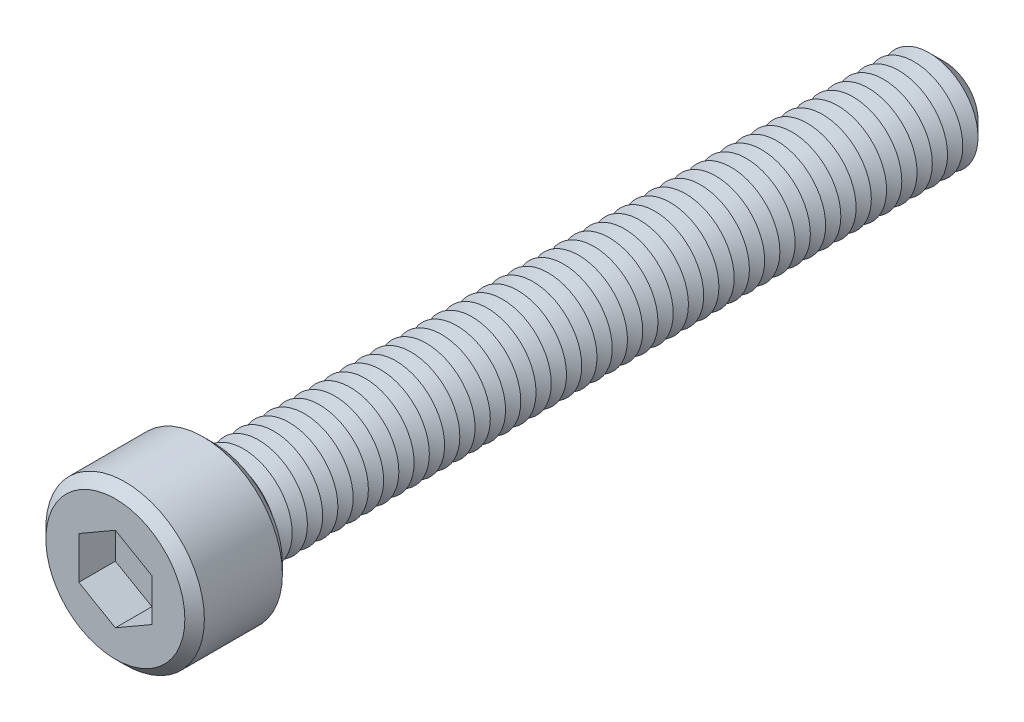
ISO-10303-21;
HEADER;
FILE_DESCRIPTION(('STEP AP214'),'2;1');
FILE_NAME('part.step','',(''),(''),'','','');
FILE_SCHEMA(('AUTOMOTIVE_DESIGN { 1 0 10303 214 1 1 1 1 }'));
ENDSEC;
DATA;
#1=APPLICATION_CONTEXT('core data for automotive mechanical design processes');
#2=APPLICATION_PROTOCOL_DEFINITION('international standard','automotive_design',2000,#1);
#3=PRODUCT_CONTEXT('',#1,'mechanical');
#4=PRODUCT('Part','Part','',(#3));
#5=PRODUCT_RELATED_PRODUCT_CATEGORY('part','',(#4));
#6=PRODUCT_DEFINITION_FORMATION('','',#4);
#7=PRODUCT_DEFINITION_CONTEXT('part definition',#1,'design');
#8=PRODUCT_DEFINITION('design','',#6,#7);
#9=PRODUCT_DEFINITION_SHAPE('','',#8);
#10=(LENGTH_UNIT() NAMED_UNIT(*) SI_UNIT(.MILLI.,.METRE.));
#11=(NAMED_UNIT(*) PLANE_ANGLE_UNIT() SI_UNIT($,.RADIAN.));
#12=(NAMED_UNIT(*) SI_UNIT($,.STERADIAN.) SOLID_ANGLE_UNIT());
#13=UNCERTAINTY_MEASURE_WITH_UNIT(LENGTH_MEASURE(1.E-05),#10,'distance_accuracy_value','');
#14=(GEOMETRIC_REPRESENTATION_CONTEXT(3) GLOBAL_UNCERTAINTY_ASSIGNED_CONTEXT((#13)) GLOBAL_UNIT_ASSIGNED_CONTEXT((#10,
#11,#12)) REPRESENTATION_CONTEXT('',''));
#15=CARTESIAN_POINT('',(0.,0.,0.));
#16=DIRECTION('',(0.,0.,1.));
#17=DIRECTION('',(1.,0.,0.));
#18=AXIS2_PLACEMENT_3D('',#15,#16,#17);
#19=CARTESIAN_POINT('',(0.,0.,8.));
#20=DIRECTION('',(0.,0.,-1.));
#21=DIRECTION('',(-1.,0.,0.));
#22=AXIS2_PLACEMENT_3D('',#19,#20,#21);
#23=CYLINDRICAL_SURFACE('',#22,6.5);
#24=CARTESIAN_POINT('',(0.,0.,0.799999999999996));
#25=DIRECTION('',(0.,0.,1.));
#26=DIRECTION('',(1.,0.,0.));
#27=AXIS2_PLACEMENT_3D('',#24,#25,#26);
#28=CIRCLE('',#27,6.5);
#29=CARTESIAN_POINT('',(6.5,0.,0.799999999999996));
#30=VERTEX_POINT('',#29);
#31=EDGE_CURVE('E552',#30,#30,#28,.T.);
#32=ORIENTED_EDGE('',*,*,#31,.T.);
#33=EDGE_LOOP('',(#32));
#34=FACE_BOUND('',#33,.T.);
#35=CARTESIAN_POINT('',(0.,0.,7.2));
#36=DIRECTION('',(0.,0.,1.));
#37=DIRECTION('',(1.,0.,0.));
#38=AXIS2_PLACEMENT_3D('',#35,#36,#37);
#39=CIRCLE('',#38,6.5);
#40=CARTESIAN_POINT('',(6.5,0.,7.2));
#41=VERTEX_POINT('',#40);
#42=EDGE_CURVE('E549',#41,#41,#39,.F.);
#43=ORIENTED_EDGE('',*,*,#42,.T.);
#44=EDGE_LOOP('',(#43));
#45=FACE_BOUND('',#44,.T.);
#46=ADVANCED_FACE('F39',(#34,#45),#23,.T.);
#47=CARTESIAN_POINT('',(0.,0.,8.));
#48=DIRECTION('',(0.,0.,1.));
#49=DIRECTION('',(1.,0.,0.));
#50=AXIS2_PLACEMENT_3D('',#47,#48,#49);
#51=PLANE('',#50);
#52=CARTESIAN_POINT('',(0.,0.,8.));
#53=DIRECTION('',(0.,0.,1.));
#54=DIRECTION('',(1.,0.,0.));
#55=AXIS2_PLACEMENT_3D('',#52,#53,#54);
#56=CIRCLE('',#55,5.70000000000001);
#57=CARTESIAN_POINT('',(5.70000000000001,0.,8.));
#58=VERTEX_POINT('',#57);
#59=EDGE_CURVE('E11',#58,#58,#56,.T.);
#60=ORIENTED_EDGE('',*,*,#59,.T.);
#61=EDGE_LOOP('',(#60));
#62=FACE_BOUND('',#61,.T.);
#63=DIRECTION('',(-0.866025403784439,0.5,0.));
#64=VECTOR('',#63,1.);
#65=CARTESIAN_POINT('',(3.,1.73205080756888,8.));
#66=LINE('',#65,#64);
#67=CARTESIAN_POINT('',(3.,1.73205080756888,8.));
#68=VERTEX_POINT('',#67);
#69=CARTESIAN_POINT('',(0.,3.46410161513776,8.));
#70=VERTEX_POINT('',#69);
#71=EDGE_CURVE('E55',#68,#70,#66,.T.);
#72=ORIENTED_EDGE('',*,*,#71,.F.);
#73=DIRECTION('',(0.,1.,0.));
#74=VECTOR('',#73,1.);
#75=CARTESIAN_POINT('',(3.,-1.73205080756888,8.));
#76=LINE('',#75,#74);
#77=CARTESIAN_POINT('',(3.,-1.73205080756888,8.));
#78=VERTEX_POINT('',#77);
#79=EDGE_CURVE('E151',#78,#68,#76,.T.);
#80=ORIENTED_EDGE('',*,*,#79,.F.);
#81=DIRECTION('',(0.866025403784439,0.5,0.));
#82=VECTOR('',#81,1.);
#83=CARTESIAN_POINT('',(0.,-3.46410161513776,8.));
#84=LINE('',#83,#82);
#85=CARTESIAN_POINT('',(0.,-3.46410161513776,8.));
#86=VERTEX_POINT('',#85);
#87=EDGE_CURVE('E148',#86,#78,#84,.T.);
#88=ORIENTED_EDGE('',*,*,#87,.F.);
#89=DIRECTION('',(0.866025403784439,-0.5,0.));
#90=VECTOR('',#89,1.);
#91=CARTESIAN_POINT('',(-3.,-1.73205080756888,8.));
#92=LINE('',#91,#90);
#93=CARTESIAN_POINT('',(-3.,-1.73205080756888,8.));
#94=VERTEX_POINT('',#93);
#95=EDGE_CURVE('E103',#94,#86,#92,.T.);
#96=ORIENTED_EDGE('',*,*,#95,.F.);
#97=DIRECTION('',(0.,-1.,0.));
#98=VECTOR('',#97,1.);
#99=CARTESIAN_POINT('',(-3.,1.73205080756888,8.));
#100=LINE('',#99,#98);
#101=CARTESIAN_POINT('',(-3.,1.73205080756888,8.));
#102=VERTEX_POINT('',#101);
#103=EDGE_CURVE('E142',#102,#94,#100,.T.);
#104=ORIENTED_EDGE('',*,*,#103,.F.);
#105=DIRECTION('',(-0.866025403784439,-0.5,0.));
#106=VECTOR('',#105,1.);
#107=CARTESIAN_POINT('',(0.,3.46410161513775,8.));
#108=LINE('',#107,#106);
#109=EDGE_CURVE('E137',#70,#102,#108,.T.);
#110=ORIENTED_EDGE('',*,*,#109,.F.);
#111=EDGE_LOOP('',(#72,#80,#88,#96,#104,#110));
#112=FACE_BOUND('',#111,.T.);
#113=ADVANCED_FACE('F570',(#62,#112),#51,.T.);
#114=CARTESIAN_POINT('',(0.,0.,0.));
#115=DIRECTION('',(0.,0.,1.));
#116=DIRECTION('',(1.,0.,0.));
#117=AXIS2_PLACEMENT_3D('',#114,#115,#116);
#118=PLANE('',#117);
#119=CARTESIAN_POINT('',(0.,0.,0.));
#120=DIRECTION('',(0.,0.,1.));
#121=DIRECTION('',(1.,0.,0.));
#122=AXIS2_PLACEMENT_3D('',#119,#120,#121);
#123=CIRCLE('',#122,5.7);
#124=CARTESIAN_POINT('',(5.7,0.,0.));
#125=VERTEX_POINT('',#124);
#126=EDGE_CURVE('E48',#125,#125,#123,.F.);
#127=ORIENTED_EDGE('',*,*,#126,.T.);
#128=EDGE_LOOP('',(#127));
#129=FACE_BOUND('',#128,.T.);
#130=CARTESIAN_POINT('',(0.,0.,0.));
#131=DIRECTION('',(0.,0.,1.));
#132=DIRECTION('',(1.,0.,0.));
#133=AXIS2_PLACEMENT_3D('',#130,#131,#132);
#134=CIRCLE('',#133,4.);
#135=CARTESIAN_POINT('',(4.,0.,0.));
#136=VERTEX_POINT('',#135);
#137=EDGE_CURVE('E541',#136,#136,#134,.T.);
#138=ORIENTED_EDGE('',*,*,#137,.T.);
#139=EDGE_LOOP('',(#138));
#140=FACE_BOUND('',#139,.T.);
#141=ADVANCED_FACE('F559',(#129,#140),#118,.F.);
#142=CARTESIAN_POINT('',(0.,0.,0.));
#143=DIRECTION('',(0.,0.,1.));
#144=DIRECTION('',(1.,0.,0.));
#145=AXIS2_PLACEMENT_3D('',#142,#143,#144);
#146=CONICAL_SURFACE('',#145,4.,1.0471975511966);
#147=CARTESIAN_POINT('',(0.,0.,-0.625));
#148=DIRECTION('',(0.,0.,1.));
#149=DIRECTION('',(1.,0.,0.));
#150=AXIS2_PLACEMENT_3D('',#147,#148,#149);
#151=CIRCLE('',#150,2.91746824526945);
#152=CARTESIAN_POINT('',(2.91746824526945,0.,-0.625));
#153=VERTEX_POINT('',#152);
#154=EDGE_CURVE('E537',#153,#153,#151,.T.);
#155=ORIENTED_EDGE('',*,*,#154,.T.);
#156=EDGE_LOOP('',(#155));
#157=FACE_BOUND('',#156,.T.);
#158=ORIENTED_EDGE('',*,*,#137,.F.);
#159=EDGE_LOOP('',(#158));
#160=FACE_BOUND('',#159,.T.);
#161=ADVANCED_FACE('F996',(#157,#160),#146,.T.);
#162=CARTESIAN_POINT('',(0.,0.,-0.625));
#163=DIRECTION('',(0.,0.,-1.));
#164=DIRECTION('',(-1.,0.,0.));
#165=AXIS2_PLACEMENT_3D('',#162,#163,#164);
#166=CONICAL_SURFACE('',#165,2.91746824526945,1.0471975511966);
#167=CARTESIAN_POINT('',(0.,0.,-1.25));
#168=DIRECTION('',(0.,0.,1.));
#169=DIRECTION('',(1.,0.,0.));
#170=AXIS2_PLACEMENT_3D('',#167,#168,#169);
#171=CIRCLE('',#170,4.);
#172=CARTESIAN_POINT('',(4.,0.,-1.25));
#173=VERTEX_POINT('',#172);
#174=EDGE_CURVE('E533',#173,#173,#171,.T.);
#175=ORIENTED_EDGE('',*,*,#174,.T.);
#176=EDGE_LOOP('',(#175));
#177=FACE_BOUND('',#176,.T.);
#178=ORIENTED_EDGE('',*,*,#154,.F.);
#179=EDGE_LOOP('',(#178));
#180=FACE_BOUND('',#179,.T.);
#181=ADVANCED_FACE('F992',(#177,#180),#166,.T.);
#182=CARTESIAN_POINT('',(0.,0.,-1.25));
#183=DIRECTION('',(0.,0.,1.));
#184=DIRECTION('',(1.,0.,0.));
#185=AXIS2_PLACEMENT_3D('',#182,#183,#184);
#186=CONICAL_SURFACE('',#185,4.,1.0471975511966);
#187=CARTESIAN_POINT('',(0.,0.,-1.875));
#188=DIRECTION('',(0.,0.,1.));
#189=DIRECTION('',(1.,0.,0.));
#190=AXIS2_PLACEMENT_3D('',#187,#188,#189);
#191=CIRCLE('',#190,2.91746824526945);
#192=CARTESIAN_POINT('',(2.91746824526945,0.,-1.875));
#193=VERTEX_POINT('',#192);
#194=EDGE_CURVE('E529',#193,#193,#191,.T.);
#195=ORIENTED_EDGE('',*,*,#194,.T.);
#196=EDGE_LOOP('',(#195));
#197=FACE_BOUND('',#196,.T.);
#198=ORIENTED_EDGE('',*,*,#174,.F.);
#199=EDGE_LOOP('',(#198));
#200=FACE_BOUND('',#199,.T.);
#201=ADVANCED_FACE('F988',(#197,#200),#186,.T.);
#202=CARTESIAN_POINT('',(0.,0.,-1.875));
#203=DIRECTION('',(0.,0.,-1.));
#204=DIRECTION('',(-1.,0.,0.));
#205=AXIS2_PLACEMENT_3D('',#202,#203,#204);
#206=CONICAL_SURFACE('',#205,2.91746824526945,1.0471975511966);
#207=CARTESIAN_POINT('',(0.,0.,-2.5));
#208=DIRECTION('',(0.,0.,1.));
#209=DIRECTION('',(1.,0.,0.));
#210=AXIS2_PLACEMENT_3D('',#207,#208,#209);
#211=CIRCLE('',#210,4.);
#212=CARTESIAN_POINT('',(4.,0.,-2.5));
#213=VERTEX_POINT('',#212);
#214=EDGE_CURVE('E525',#213,#213,#211,.T.);
#215=ORIENTED_EDGE('',*,*,#214,.T.);
#216=EDGE_LOOP('',(#215));
#217=FACE_BOUND('',#216,.T.);
#218=ORIENTED_EDGE('',*,*,#194,.F.);
#219=EDGE_LOOP('',(#218));
#220=FACE_BOUND('',#219,.T.);
#221=ADVANCED_FACE('F984',(#217,#220),#206,.T.);
#222=CARTESIAN_POINT('',(0.,0.,-2.5));
#223=DIRECTION('',(0.,0.,1.));
#224=DIRECTION('',(1.,0.,0.));
#225=AXIS2_PLACEMENT_3D('',#222,#223,#224);
#226=CONICAL_SURFACE('',#225,4.,1.0471975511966);
#227=CARTESIAN_POINT('',(0.,0.,-3.125));
#228=DIRECTION('',(0.,0.,1.));
#229=DIRECTION('',(1.,0.,0.));
#230=AXIS2_PLACEMENT_3D('',#227,#228,#229);
#231=CIRCLE('',#230,2.91746824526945);
#232=CARTESIAN_POINT('',(2.91746824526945,0.,-3.125));
#233=VERTEX_POINT('',#232);
#234=EDGE_CURVE('E521',#233,#233,#231,.T.);
#235=ORIENTED_EDGE('',*,*,#234,.T.);
#236=EDGE_LOOP('',(#235));
#237=FACE_BOUND('',#236,.T.);
#238=ORIENTED_EDGE('',*,*,#214,.F.);
#239=EDGE_LOOP('',(#238));
#240=FACE_BOUND('',#239,.T.);
#241=ADVANCED_FACE('F980',(#237,#240),#226,.T.);
#242=CARTESIAN_POINT('',(0.,0.,-3.125));
#243=DIRECTION('',(0.,0.,-1.));
#244=DIRECTION('',(-1.,0.,0.));
#245=AXIS2_PLACEMENT_3D('',#242,#243,#244);
#246=CONICAL_SURFACE('',#245,2.91746824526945,1.0471975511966);
#247=CARTESIAN_POINT('',(0.,0.,-3.75));
#248=DIRECTION('',(0.,0.,1.));
#249=DIRECTION('',(1.,0.,0.));
#250=AXIS2_PLACEMENT_3D('',#247,#248,#249);
#251=CIRCLE('',#250,4.);
#252=CARTESIAN_POINT('',(4.,0.,-3.75));
#253=VERTEX_POINT('',#252);
#254=EDGE_CURVE('E517',#253,#253,#251,.T.);
#255=ORIENTED_EDGE('',*,*,#254,.T.);
#256=EDGE_LOOP('',(#255));
#257=FACE_BOUND('',#256,.T.);
#258=ORIENTED_EDGE('',*,*,#234,.F.);
#259=EDGE_LOOP('',(#258));
#260=FACE_BOUND('',#259,.T.);
#261=ADVANCED_FACE('F976',(#257,#260),#246,.T.);
#262=CARTESIAN_POINT('',(0.,0.,-3.75));
#263=DIRECTION('',(0.,0.,1.));
#264=DIRECTION('',(1.,0.,0.));
#265=AXIS2_PLACEMENT_3D('',#262,#263,#264);
#266=CONICAL_SURFACE('',#265,4.,1.0471975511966);
#267=CARTESIAN_POINT('',(0.,0.,-4.375));
#268=DIRECTION('',(0.,0.,1.));
#269=DIRECTION('',(1.,0.,0.));
#270=AXIS2_PLACEMENT_3D('',#267,#268,#269);
#271=CIRCLE('',#270,2.91746824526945);
#272=CARTESIAN_POINT('',(2.91746824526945,0.,-4.375));
#273=VERTEX_POINT('',#272);
#274=EDGE_CURVE('E513',#273,#273,#271,.T.);
#275=ORIENTED_EDGE('',*,*,#274,.T.);
#276=EDGE_LOOP('',(#275));
#277=FACE_BOUND('',#276,.T.);
#278=ORIENTED_EDGE('',*,*,#254,.F.);
#279=EDGE_LOOP('',(#278));
#280=FACE_BOUND('',#279,.T.);
#281=ADVANCED_FACE('F972',(#277,#280),#266,.T.);
#282=CARTESIAN_POINT('',(0.,0.,-4.375));
#283=DIRECTION('',(0.,0.,-1.));
#284=DIRECTION('',(-1.,0.,0.));
#285=AXIS2_PLACEMENT_3D('',#282,#283,#284);
#286=CONICAL_SURFACE('',#285,2.91746824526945,1.0471975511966);
#287=CARTESIAN_POINT('',(0.,0.,-5.));
#288=DIRECTION('',(0.,0.,1.));
#289=DIRECTION('',(1.,0.,0.));
#290=AXIS2_PLACEMENT_3D('',#287,#288,#289);
#291=CIRCLE('',#290,4.);
#292=CARTESIAN_POINT('',(4.,0.,-5.));
#293=VERTEX_POINT('',#292);
#294=EDGE_CURVE('E509',#293,#293,#291,.T.);
#295=ORIENTED_EDGE('',*,*,#294,.T.);
#296=EDGE_LOOP('',(#295));
#297=FACE_BOUND('',#296,.T.);
#298=ORIENTED_EDGE('',*,*,#274,.F.);
#299=EDGE_LOOP('',(#298));
#300=FACE_BOUND('',#299,.T.);
#301=ADVANCED_FACE('F968',(#297,#300),#286,.T.);
#302=CARTESIAN_POINT('',(0.,0.,-5.));
#303=DIRECTION('',(0.,0.,1.));
#304=DIRECTION('',(1.,0.,0.));
#305=AXIS2_PLACEMENT_3D('',#302,#303,#304);
#306=CONICAL_SURFACE('',#305,4.,1.0471975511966);
#307=CARTESIAN_POINT('',(0.,0.,-5.625));
#308=DIRECTION('',(0.,0.,1.));
#309=DIRECTION('',(1.,0.,0.));
#310=AXIS2_PLACEMENT_3D('',#307,#308,#309);
#311=CIRCLE('',#310,2.91746824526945);
#312=CARTESIAN_POINT('',(2.91746824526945,0.,-5.625));
#313=VERTEX_POINT('',#312);
#314=EDGE_CURVE('E505',#313,#313,#311,.T.);
#315=ORIENTED_EDGE('',*,*,#314,.T.);
#316=EDGE_LOOP('',(#315));
#317=FACE_BOUND('',#316,.T.);
#318=ORIENTED_EDGE('',*,*,#294,.F.);
#319=EDGE_LOOP('',(#318));
#320=FACE_BOUND('',#319,.T.);
#321=ADVANCED_FACE('F964',(#317,#320),#306,.T.);
#322=CARTESIAN_POINT('',(0.,0.,-5.625));
#323=DIRECTION('',(0.,0.,-1.));
#324=DIRECTION('',(-1.,0.,0.));
#325=AXIS2_PLACEMENT_3D('',#322,#323,#324);
#326=CONICAL_SURFACE('',#325,2.91746824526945,1.0471975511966);
#327=CARTESIAN_POINT('',(0.,0.,-6.25));
#328=DIRECTION('',(0.,0.,1.));
#329=DIRECTION('',(1.,0.,0.));
#330=AXIS2_PLACEMENT_3D('',#327,#328,#329);
#331=CIRCLE('',#330,4.);
#332=CARTESIAN_POINT('',(4.,0.,-6.25));
#333=VERTEX_POINT('',#332);
#334=EDGE_CURVE('E501',#333,#333,#331,.T.);
#335=ORIENTED_EDGE('',*,*,#334,.T.);
#336=EDGE_LOOP('',(#335));
#337=FACE_BOUND('',#336,.T.);
#338=ORIENTED_EDGE('',*,*,#314,.F.);
#339=EDGE_LOOP('',(#338));
#340=FACE_BOUND('',#339,.T.);
#341=ADVANCED_FACE('F960',(#337,#340),#326,.T.);
#342=CARTESIAN_POINT('',(0.,0.,-6.25));
#343=DIRECTION('',(0.,0.,1.));
#344=DIRECTION('',(1.,0.,0.));
#345=AXIS2_PLACEMENT_3D('',#342,#343,#344);
#346=CONICAL_SURFACE('',#345,4.,1.0471975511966);
#347=CARTESIAN_POINT('',(0.,0.,-6.875));
#348=DIRECTION('',(0.,0.,1.));
#349=DIRECTION('',(1.,0.,0.));
#350=AXIS2_PLACEMENT_3D('',#347,#348,#349);
#351=CIRCLE('',#350,2.91746824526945);
#352=CARTESIAN_POINT('',(2.91746824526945,0.,-6.875));
#353=VERTEX_POINT('',#352);
#354=EDGE_CURVE('E497',#353,#353,#351,.T.);
#355=ORIENTED_EDGE('',*,*,#354,.T.);
#356=EDGE_LOOP('',(#355));
#357=FACE_BOUND('',#356,.T.);
#358=ORIENTED_EDGE('',*,*,#334,.F.);
#359=EDGE_LOOP('',(#358));
#360=FACE_BOUND('',#359,.T.);
#361=ADVANCED_FACE('F956',(#357,#360),#346,.T.);
#362=CARTESIAN_POINT('',(0.,0.,-6.875));
#363=DIRECTION('',(0.,0.,-1.));
#364=DIRECTION('',(-1.,0.,0.));
#365=AXIS2_PLACEMENT_3D('',#362,#363,#364);
#366=CONICAL_SURFACE('',#365,2.91746824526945,1.0471975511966);
#367=CARTESIAN_POINT('',(0.,0.,-7.5));
#368=DIRECTION('',(0.,0.,1.));
#369=DIRECTION('',(1.,0.,0.));
#370=AXIS2_PLACEMENT_3D('',#367,#368,#369);
#371=CIRCLE('',#370,4.);
#372=CARTESIAN_POINT('',(4.,0.,-7.5));
#373=VERTEX_POINT('',#372);
#374=EDGE_CURVE('E493',#373,#373,#371,.T.);
#375=ORIENTED_EDGE('',*,*,#374,.T.);
#376=EDGE_LOOP('',(#375));
#377=FACE_BOUND('',#376,.T.);
#378=ORIENTED_EDGE('',*,*,#354,.F.);
#379=EDGE_LOOP('',(#378));
#380=FACE_BOUND('',#379,.T.);
#381=ADVANCED_FACE('F952',(#377,#380),#366,.T.);
#382=CARTESIAN_POINT('',(0.,0.,-7.5));
#383=DIRECTION('',(0.,0.,1.));
#384=DIRECTION('',(1.,0.,0.));
#385=AXIS2_PLACEMENT_3D('',#382,#383,#384);
#386=CONICAL_SURFACE('',#385,4.,1.0471975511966);
#387=CARTESIAN_POINT('',(0.,0.,-8.125));
#388=DIRECTION('',(0.,0.,1.));
#389=DIRECTION('',(1.,0.,0.));
#390=AXIS2_PLACEMENT_3D('',#387,#388,#389);
#391=CIRCLE('',#390,2.91746824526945);
#392=CARTESIAN_POINT('',(2.91746824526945,0.,-8.125));
#393=VERTEX_POINT('',#392);
#394=EDGE_CURVE('E489',#393,#393,#391,.T.);
#395=ORIENTED_EDGE('',*,*,#394,.T.);
#396=EDGE_LOOP('',(#395));
#397=FACE_BOUND('',#396,.T.);
#398=ORIENTED_EDGE('',*,*,#374,.F.);
#399=EDGE_LOOP('',(#398));
#400=FACE_BOUND('',#399,.T.);
#401=ADVANCED_FACE('F948',(#397,#400),#386,.T.);
#402=CARTESIAN_POINT('',(0.,0.,-8.125));
#403=DIRECTION('',(0.,0.,-1.));
#404=DIRECTION('',(-1.,0.,0.));
#405=AXIS2_PLACEMENT_3D('',#402,#403,#404);
#406=CONICAL_SURFACE('',#405,2.91746824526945,1.0471975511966);
#407=CARTESIAN_POINT('',(0.,0.,-8.75));
#408=DIRECTION('',(0.,0.,1.));
#409=DIRECTION('',(1.,0.,0.));
#410=AXIS2_PLACEMENT_3D('',#407,#408,#409);
#411=CIRCLE('',#410,4.);
#412=CARTESIAN_POINT('',(4.,0.,-8.75));
#413=VERTEX_POINT('',#412);
#414=EDGE_CURVE('E485',#413,#413,#411,.T.);
#415=ORIENTED_EDGE('',*,*,#414,.T.);
#416=EDGE_LOOP('',(#415));
#417=FACE_BOUND('',#416,.T.);
#418=ORIENTED_EDGE('',*,*,#394,.F.);
#419=EDGE_LOOP('',(#418));
#420=FACE_BOUND('',#419,.T.);
#421=ADVANCED_FACE('F944',(#417,#420),#406,.T.);
#422=CARTESIAN_POINT('',(0.,0.,-8.75));
#423=DIRECTION('',(0.,0.,1.));
#424=DIRECTION('',(1.,0.,0.));
#425=AXIS2_PLACEMENT_3D('',#422,#423,#424);
#426=CONICAL_SURFACE('',#425,4.,1.0471975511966);
#427=CARTESIAN_POINT('',(0.,0.,-9.375));
#428=DIRECTION('',(0.,0.,1.));
#429=DIRECTION('',(1.,0.,0.));
#430=AXIS2_PLACEMENT_3D('',#427,#428,#429);
#431=CIRCLE('',#430,2.91746824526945);
#432=CARTESIAN_POINT('',(2.91746824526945,0.,-9.375));
#433=VERTEX_POINT('',#432);
#434=EDGE_CURVE('E481',#433,#433,#431,.T.);
#435=ORIENTED_EDGE('',*,*,#434,.T.);
#436=EDGE_LOOP('',(#435));
#437=FACE_BOUND('',#436,.T.);
#438=ORIENTED_EDGE('',*,*,#414,.F.);
#439=EDGE_LOOP('',(#438));
#440=FACE_BOUND('',#439,.T.);
#441=ADVANCED_FACE('F940',(#437,#440),#426,.T.);
#442=CARTESIAN_POINT('',(0.,0.,-9.375));
#443=DIRECTION('',(0.,0.,-1.));
#444=DIRECTION('',(-1.,0.,0.));
#445=AXIS2_PLACEMENT_3D('',#442,#443,#444);
#446=CONICAL_SURFACE('',#445,2.91746824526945,1.0471975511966);
#447=CARTESIAN_POINT('',(0.,0.,-10.));
#448=DIRECTION('',(0.,0.,1.));
#449=DIRECTION('',(1.,0.,0.));
#450=AXIS2_PLACEMENT_3D('',#447,#448,#449);
#451=CIRCLE('',#450,4.);
#452=CARTESIAN_POINT('',(4.,0.,-10.));
#453=VERTEX_POINT('',#452);
#454=EDGE_CURVE('E477',#453,#453,#451,.T.);
#455=ORIENTED_EDGE('',*,*,#454,.T.);
#456=EDGE_LOOP('',(#455));
#457=FACE_BOUND('',#456,.T.);
#458=ORIENTED_EDGE('',*,*,#434,.F.);
#459=EDGE_LOOP('',(#458));
#460=FACE_BOUND('',#459,.T.);
#461=ADVANCED_FACE('F936',(#457,#460),#446,.T.);
#462=CARTESIAN_POINT('',(0.,0.,-10.));
#463=DIRECTION('',(0.,0.,1.));
#464=DIRECTION('',(1.,0.,0.));
#465=AXIS2_PLACEMENT_3D('',#462,#463,#464);
#466=CONICAL_SURFACE('',#465,4.,1.0471975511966);
#467=CARTESIAN_POINT('',(0.,0.,-10.625));
#468=DIRECTION('',(0.,0.,1.));
#469=DIRECTION('',(1.,0.,0.));
#470=AXIS2_PLACEMENT_3D('',#467,#468,#469);
#471=CIRCLE('',#470,2.91746824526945);
#472=CARTESIAN_POINT('',(2.91746824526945,0.,-10.625));
#473=VERTEX_POINT('',#472);
#474=EDGE_CURVE('E473',#473,#473,#471,.T.);
#475=ORIENTED_EDGE('',*,*,#474,.T.);
#476=EDGE_LOOP('',(#475));
#477=FACE_BOUND('',#476,.T.);
#478=ORIENTED_EDGE('',*,*,#454,.F.);
#479=EDGE_LOOP('',(#478));
#480=FACE_BOUND('',#479,.T.);
#481=ADVANCED_FACE('F932',(#477,#480),#466,.T.);
#482=CARTESIAN_POINT('',(0.,0.,-10.625));
#483=DIRECTION('',(0.,0.,-1.));
#484=DIRECTION('',(-1.,0.,0.));
#485=AXIS2_PLACEMENT_3D('',#482,#483,#484);
#486=CONICAL_SURFACE('',#485,2.91746824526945,1.0471975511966);
#487=CARTESIAN_POINT('',(0.,0.,-11.25));
#488=DIRECTION('',(0.,0.,1.));
#489=DIRECTION('',(1.,0.,0.));
#490=AXIS2_PLACEMENT_3D('',#487,#488,#489);
#491=CIRCLE('',#490,4.);
#492=CARTESIAN_POINT('',(4.,0.,-11.25));
#493=VERTEX_POINT('',#492);
#494=EDGE_CURVE('E469',#493,#493,#491,.T.);
#495=ORIENTED_EDGE('',*,*,#494,.T.);
#496=EDGE_LOOP('',(#495));
#497=FACE_BOUND('',#496,.T.);
#498=ORIENTED_EDGE('',*,*,#474,.F.);
#499=EDGE_LOOP('',(#498));
#500=FACE_BOUND('',#499,.T.);
#501=ADVANCED_FACE('F928',(#497,#500),#486,.T.);
#502=CARTESIAN_POINT('',(0.,0.,-11.25));
#503=DIRECTION('',(0.,0.,1.));
#504=DIRECTION('',(1.,0.,0.));
#505=AXIS2_PLACEMENT_3D('',#502,#503,#504);
#506=CONICAL_SURFACE('',#505,4.,1.0471975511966);
#507=CARTESIAN_POINT('',(0.,0.,-11.875));
#508=DIRECTION('',(0.,0.,1.));
#509=DIRECTION('',(1.,0.,0.));
#510=AXIS2_PLACEMENT_3D('',#507,#508,#509);
#511=CIRCLE('',#510,2.91746824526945);
#512=CARTESIAN_POINT('',(2.91746824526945,0.,-11.875));
#513=VERTEX_POINT('',#512);
#514=EDGE_CURVE('E465',#513,#513,#511,.T.);
#515=ORIENTED_EDGE('',*,*,#514,.T.);
#516=EDGE_LOOP('',(#515));
#517=FACE_BOUND('',#516,.T.);
#518=ORIENTED_EDGE('',*,*,#494,.F.);
#519=EDGE_LOOP('',(#518));
#520=FACE_BOUND('',#519,.T.);
#521=ADVANCED_FACE('F924',(#517,#520),#506,.T.);
#522=CARTESIAN_POINT('',(0.,0.,-11.875));
#523=DIRECTION('',(0.,0.,-1.));
#524=DIRECTION('',(-1.,0.,0.));
#525=AXIS2_PLACEMENT_3D('',#522,#523,#524);
#526=CONICAL_SURFACE('',#525,2.91746824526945,1.0471975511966);
#527=CARTESIAN_POINT('',(0.,0.,-12.5));
#528=DIRECTION('',(0.,0.,1.));
#529=DIRECTION('',(1.,0.,0.));
#530=AXIS2_PLACEMENT_3D('',#527,#528,#529);
#531=CIRCLE('',#530,4.);
#532=CARTESIAN_POINT('',(4.,0.,-12.5));
#533=VERTEX_POINT('',#532);
#534=EDGE_CURVE('E461',#533,#533,#531,.T.);
#535=ORIENTED_EDGE('',*,*,#534,.T.);
#536=EDGE_LOOP('',(#535));
#537=FACE_BOUND('',#536,.T.);
#538=ORIENTED_EDGE('',*,*,#514,.F.);
#539=EDGE_LOOP('',(#538));
#540=FACE_BOUND('',#539,.T.);
#541=ADVANCED_FACE('F920',(#537,#540),#526,.T.);
#542=CARTESIAN_POINT('',(0.,0.,-12.5));
#543=DIRECTION('',(0.,0.,1.));
#544=DIRECTION('',(1.,0.,0.));
#545=AXIS2_PLACEMENT_3D('',#542,#543,#544);
#546=CONICAL_SURFACE('',#545,4.,1.0471975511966);
#547=CARTESIAN_POINT('',(0.,0.,-13.125));
#548=DIRECTION('',(0.,0.,1.));
#549=DIRECTION('',(1.,0.,0.));
#550=AXIS2_PLACEMENT_3D('',#547,#548,#549);
#551=CIRCLE('',#550,2.91746824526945);
#552=CARTESIAN_POINT('',(2.91746824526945,0.,-13.125));
#553=VERTEX_POINT('',#552);
#554=EDGE_CURVE('E457',#553,#553,#551,.T.);
#555=ORIENTED_EDGE('',*,*,#554,.T.);
#556=EDGE_LOOP('',(#555));
#557=FACE_BOUND('',#556,.T.);
#558=ORIENTED_EDGE('',*,*,#534,.F.);
#559=EDGE_LOOP('',(#558));
#560=FACE_BOUND('',#559,.T.);
#561=ADVANCED_FACE('F916',(#557,#560),#546,.T.);
#562=CARTESIAN_POINT('',(0.,0.,-13.125));
#563=DIRECTION('',(0.,0.,-1.));
#564=DIRECTION('',(-1.,0.,0.));
#565=AXIS2_PLACEMENT_3D('',#562,#563,#564);
#566=CONICAL_SURFACE('',#565,2.91746824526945,1.0471975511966);
#567=CARTESIAN_POINT('',(0.,0.,-13.75));
#568=DIRECTION('',(0.,0.,1.));
#569=DIRECTION('',(1.,0.,0.));
#570=AXIS2_PLACEMENT_3D('',#567,#568,#569);
#571=CIRCLE('',#570,4.);
#572=CARTESIAN_POINT('',(4.,0.,-13.75));
#573=VERTEX_POINT('',#572);
#574=EDGE_CURVE('E453',#573,#573,#571,.T.);
#575=ORIENTED_EDGE('',*,*,#574,.T.);
#576=EDGE_LOOP('',(#575));
#577=FACE_BOUND('',#576,.T.);
#578=ORIENTED_EDGE('',*,*,#554,.F.);
#579=EDGE_LOOP('',(#578));
#580=FACE_BOUND('',#579,.T.);
#581=ADVANCED_FACE('F912',(#577,#580),#566,.T.);
#582=CARTESIAN_POINT('',(0.,0.,-13.75));
#583=DIRECTION('',(0.,0.,1.));
#584=DIRECTION('',(1.,0.,0.));
#585=AXIS2_PLACEMENT_3D('',#582,#583,#584);
#586=CONICAL_SURFACE('',#585,4.,1.0471975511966);
#587=CARTESIAN_POINT('',(0.,0.,-14.375));
#588=DIRECTION('',(0.,0.,1.));
#589=DIRECTION('',(1.,0.,0.));
#590=AXIS2_PLACEMENT_3D('',#587,#588,#589);
#591=CIRCLE('',#590,2.91746824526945);
#592=CARTESIAN_POINT('',(2.91746824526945,0.,-14.375));
#593=VERTEX_POINT('',#592);
#594=EDGE_CURVE('E449',#593,#593,#591,.T.);
#595=ORIENTED_EDGE('',*,*,#594,.T.);
#596=EDGE_LOOP('',(#595));
#597=FACE_BOUND('',#596,.T.);
#598=ORIENTED_EDGE('',*,*,#574,.F.);
#599=EDGE_LOOP('',(#598));
#600=FACE_BOUND('',#599,.T.);
#601=ADVANCED_FACE('F908',(#597,#600),#586,.T.);
#602=CARTESIAN_POINT('',(0.,0.,-14.375));
#603=DIRECTION('',(0.,0.,-1.));
#604=DIRECTION('',(-1.,0.,0.));
#605=AXIS2_PLACEMENT_3D('',#602,#603,#604);
#606=CONICAL_SURFACE('',#605,2.91746824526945,1.0471975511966);
#607=CARTESIAN_POINT('',(0.,0.,-15.));
#608=DIRECTION('',(0.,0.,1.));
#609=DIRECTION('',(1.,0.,0.));
#610=AXIS2_PLACEMENT_3D('',#607,#608,#609);
#611=CIRCLE('',#610,4.);
#612=CARTESIAN_POINT('',(4.,0.,-15.));
#613=VERTEX_POINT('',#612);
#614=EDGE_CURVE('E445',#613,#613,#611,.T.);
#615=ORIENTED_EDGE('',*,*,#614,.T.);
#616=EDGE_LOOP('',(#615));
#617=FACE_BOUND('',#616,.T.);
#618=ORIENTED_EDGE('',*,*,#594,.F.);
#619=EDGE_LOOP('',(#618));
#620=FACE_BOUND('',#619,.T.);
#621=ADVANCED_FACE('F904',(#617,#620),#606,.T.);
#622=CARTESIAN_POINT('',(0.,0.,-15.));
#623=DIRECTION('',(0.,0.,1.));
#624=DIRECTION('',(1.,0.,0.));
#625=AXIS2_PLACEMENT_3D('',#622,#623,#624);
#626=CONICAL_SURFACE('',#625,4.,1.0471975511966);
#627=CARTESIAN_POINT('',(0.,0.,-15.625));
#628=DIRECTION('',(0.,0.,1.));
#629=DIRECTION('',(1.,0.,0.));
#630=AXIS2_PLACEMENT_3D('',#627,#628,#629);
#631=CIRCLE('',#630,2.91746824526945);
#632=CARTESIAN_POINT('',(2.91746824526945,0.,-15.625));
#633=VERTEX_POINT('',#632);
#634=EDGE_CURVE('E441',#633,#633,#631,.T.);
#635=ORIENTED_EDGE('',*,*,#634,.T.);
#636=EDGE_LOOP('',(#635));
#637=FACE_BOUND('',#636,.T.);
#638=ORIENTED_EDGE('',*,*,#614,.F.);
#639=EDGE_LOOP('',(#638));
#640=FACE_BOUND('',#639,.T.);
#641=ADVANCED_FACE('F900',(#637,#640),#626,.T.);
#642=CARTESIAN_POINT('',(0.,0.,-15.625));
#643=DIRECTION('',(0.,0.,-1.));
#644=DIRECTION('',(-1.,0.,0.));
#645=AXIS2_PLACEMENT_3D('',#642,#643,#644);
#646=CONICAL_SURFACE('',#645,2.91746824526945,1.0471975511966);
#647=CARTESIAN_POINT('',(0.,0.,-16.25));
#648=DIRECTION('',(0.,0.,1.));
#649=DIRECTION('',(1.,0.,0.));
#650=AXIS2_PLACEMENT_3D('',#647,#648,#649);
#651=CIRCLE('',#650,4.);
#652=CARTESIAN_POINT('',(4.,0.,-16.25));
#653=VERTEX_POINT('',#652);
#654=EDGE_CURVE('E437',#653,#653,#651,.T.);
#655=ORIENTED_EDGE('',*,*,#654,.T.);
#656=EDGE_LOOP('',(#655));
#657=FACE_BOUND('',#656,.T.);
#658=ORIENTED_EDGE('',*,*,#634,.F.);
#659=EDGE_LOOP('',(#658));
#660=FACE_BOUND('',#659,.T.);
#661=ADVANCED_FACE('F896',(#657,#660),#646,.T.);
#662=CARTESIAN_POINT('',(0.,0.,-16.25));
#663=DIRECTION('',(0.,0.,1.));
#664=DIRECTION('',(1.,0.,0.));
#665=AXIS2_PLACEMENT_3D('',#662,#663,#664);
#666=CONICAL_SURFACE('',#665,4.,1.0471975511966);
#667=CARTESIAN_POINT('',(0.,0.,-16.875));
#668=DIRECTION('',(0.,0.,1.));
#669=DIRECTION('',(1.,0.,0.));
#670=AXIS2_PLACEMENT_3D('',#667,#668,#669);
#671=CIRCLE('',#670,2.91746824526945);
#672=CARTESIAN_POINT('',(2.91746824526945,0.,-16.875));
#673=VERTEX_POINT('',#672);
#674=EDGE_CURVE('E433',#673,#673,#671,.T.);
#675=ORIENTED_EDGE('',*,*,#674,.T.);
#676=EDGE_LOOP('',(#675));
#677=FACE_BOUND('',#676,.T.);
#678=ORIENTED_EDGE('',*,*,#654,.F.);
#679=EDGE_LOOP('',(#678));
#680=FACE_BOUND('',#679,.T.);
#681=ADVANCED_FACE('F892',(#677,#680),#666,.T.);
#682=CARTESIAN_POINT('',(0.,0.,-16.875));
#683=DIRECTION('',(0.,0.,-1.));
#684=DIRECTION('',(-1.,0.,0.));
#685=AXIS2_PLACEMENT_3D('',#682,#683,#684);
#686=CONICAL_SURFACE('',#685,2.91746824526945,1.0471975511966);
#687=CARTESIAN_POINT('',(0.,0.,-17.5));
#688=DIRECTION('',(0.,0.,1.));
#689=DIRECTION('',(1.,0.,0.));
#690=AXIS2_PLACEMENT_3D('',#687,#688,#689);
#691=CIRCLE('',#690,4.);
#692=CARTESIAN_POINT('',(4.,0.,-17.5));
#693=VERTEX_POINT('',#692);
#694=EDGE_CURVE('E429',#693,#693,#691,.T.);
#695=ORIENTED_EDGE('',*,*,#694,.T.);
#696=EDGE_LOOP('',(#695));
#697=FACE_BOUND('',#696,.T.);
#698=ORIENTED_EDGE('',*,*,#674,.F.);
#699=EDGE_LOOP('',(#698));
#700=FACE_BOUND('',#699,.T.);
#701=ADVANCED_FACE('F888',(#697,#700),#686,.T.);
#702=CARTESIAN_POINT('',(0.,0.,-17.5));
#703=DIRECTION('',(0.,0.,1.));
#704=DIRECTION('',(1.,0.,0.));
#705=AXIS2_PLACEMENT_3D('',#702,#703,#704);
#706=CONICAL_SURFACE('',#705,4.,1.0471975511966);
#707=CARTESIAN_POINT('',(0.,0.,-18.125));
#708=DIRECTION('',(0.,0.,1.));
#709=DIRECTION('',(1.,0.,0.));
#710=AXIS2_PLACEMENT_3D('',#707,#708,#709);
#711=CIRCLE('',#710,2.91746824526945);
#712=CARTESIAN_POINT('',(2.91746824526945,0.,-18.125));
#713=VERTEX_POINT('',#712);
#714=EDGE_CURVE('E425',#713,#713,#711,.T.);
#715=ORIENTED_EDGE('',*,*,#714,.T.);
#716=EDGE_LOOP('',(#715));
#717=FACE_BOUND('',#716,.T.);
#718=ORIENTED_EDGE('',*,*,#694,.F.);
#719=EDGE_LOOP('',(#718));
#720=FACE_BOUND('',#719,.T.);
#721=ADVANCED_FACE('F884',(#717,#720),#706,.T.);
#722=CARTESIAN_POINT('',(0.,0.,-18.125));
#723=DIRECTION('',(0.,0.,-1.));
#724=DIRECTION('',(-1.,0.,0.));
#725=AXIS2_PLACEMENT_3D('',#722,#723,#724);
#726=CONICAL_SURFACE('',#725,2.91746824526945,1.0471975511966);
#727=CARTESIAN_POINT('',(0.,0.,-18.75));
#728=DIRECTION('',(0.,0.,1.));
#729=DIRECTION('',(1.,0.,0.));
#730=AXIS2_PLACEMENT_3D('',#727,#728,#729);
#731=CIRCLE('',#730,4.);
#732=CARTESIAN_POINT('',(4.,0.,-18.75));
#733=VERTEX_POINT('',#732);
#734=EDGE_CURVE('E421',#733,#733,#731,.T.);
#735=ORIENTED_EDGE('',*,*,#734,.T.);
#736=EDGE_LOOP('',(#735));
#737=FACE_BOUND('',#736,.T.);
#738=ORIENTED_EDGE('',*,*,#714,.F.);
#739=EDGE_LOOP('',(#738));
#740=FACE_BOUND('',#739,.T.);
#741=ADVANCED_FACE('F880',(#737,#740),#726,.T.);
#742=CARTESIAN_POINT('',(0.,0.,-18.75));
#743=DIRECTION('',(0.,0.,1.));
#744=DIRECTION('',(1.,0.,0.));
#745=AXIS2_PLACEMENT_3D('',#742,#743,#744);
#746=CONICAL_SURFACE('',#745,4.,1.0471975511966);
#747=CARTESIAN_POINT('',(0.,0.,-19.375));
#748=DIRECTION('',(0.,0.,1.));
#749=DIRECTION('',(1.,0.,0.));
#750=AXIS2_PLACEMENT_3D('',#747,#748,#749);
#751=CIRCLE('',#750,2.91746824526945);
#752=CARTESIAN_POINT('',(2.91746824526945,0.,-19.375));
#753=VERTEX_POINT('',#752);
#754=EDGE_CURVE('E417',#753,#753,#751,.T.);
#755=ORIENTED_EDGE('',*,*,#754,.T.);
#756=EDGE_LOOP('',(#755));
#757=FACE_BOUND('',#756,.T.);
#758=ORIENTED_EDGE('',*,*,#734,.F.);
#759=EDGE_LOOP('',(#758));
#760=FACE_BOUND('',#759,.T.);
#761=ADVANCED_FACE('F876',(#757,#760),#746,.T.);
#762=CARTESIAN_POINT('',(0.,0.,-19.375));
#763=DIRECTION('',(0.,0.,-1.));
#764=DIRECTION('',(-1.,0.,0.));
#765=AXIS2_PLACEMENT_3D('',#762,#763,#764);
#766=CONICAL_SURFACE('',#765,2.91746824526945,1.0471975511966);
#767=CARTESIAN_POINT('',(0.,0.,-20.));
#768=DIRECTION('',(0.,0.,1.));
#769=DIRECTION('',(1.,0.,0.));
#770=AXIS2_PLACEMENT_3D('',#767,#768,#769);
#771=CIRCLE('',#770,4.);
#772=CARTESIAN_POINT('',(4.,0.,-20.));
#773=VERTEX_POINT('',#772);
#774=EDGE_CURVE('E413',#773,#773,#771,.T.);
#775=ORIENTED_EDGE('',*,*,#774,.T.);
#776=EDGE_LOOP('',(#775));
#777=FACE_BOUND('',#776,.T.);
#778=ORIENTED_EDGE('',*,*,#754,.F.);
#779=EDGE_LOOP('',(#778));
#780=FACE_BOUND('',#779,.T.);
#781=ADVANCED_FACE('F872',(#777,#780),#766,.T.);
#782=CARTESIAN_POINT('',(0.,0.,-20.));
#783=DIRECTION('',(0.,0.,1.));
#784=DIRECTION('',(1.,0.,0.));
#785=AXIS2_PLACEMENT_3D('',#782,#783,#784);
#786=CONICAL_SURFACE('',#785,4.,1.0471975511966);
#787=CARTESIAN_POINT('',(0.,0.,-20.625));
#788=DIRECTION('',(0.,0.,1.));
#789=DIRECTION('',(1.,0.,0.));
#790=AXIS2_PLACEMENT_3D('',#787,#788,#789);
#791=CIRCLE('',#790,2.91746824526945);
#792=CARTESIAN_POINT('',(2.91746824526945,0.,-20.625));
#793=VERTEX_POINT('',#792);
#794=EDGE_CURVE('E409',#793,#793,#791,.T.);
#795=ORIENTED_EDGE('',*,*,#794,.T.);
#796=EDGE_LOOP('',(#795));
#797=FACE_BOUND('',#796,.T.);
#798=ORIENTED_EDGE('',*,*,#774,.F.);
#799=EDGE_LOOP('',(#798));
#800=FACE_BOUND('',#799,.T.);
#801=ADVANCED_FACE('F868',(#797,#800),#786,.T.);
#802=CARTESIAN_POINT('',(0.,0.,-20.625));
#803=DIRECTION('',(0.,0.,-1.));
#804=DIRECTION('',(-1.,0.,0.));
#805=AXIS2_PLACEMENT_3D('',#802,#803,#804);
#806=CONICAL_SURFACE('',#805,2.91746824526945,1.0471975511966);
#807=CARTESIAN_POINT('',(0.,0.,-21.25));
#808=DIRECTION('',(0.,0.,1.));
#809=DIRECTION('',(1.,0.,0.));
#810=AXIS2_PLACEMENT_3D('',#807,#808,#809);
#811=CIRCLE('',#810,4.);
#812=CARTESIAN_POINT('',(4.,0.,-21.25));
#813=VERTEX_POINT('',#812);
#814=EDGE_CURVE('E405',#813,#813,#811,.T.);
#815=ORIENTED_EDGE('',*,*,#814,.T.);
#816=EDGE_LOOP('',(#815));
#817=FACE_BOUND('',#816,.T.);
#818=ORIENTED_EDGE('',*,*,#794,.F.);
#819=EDGE_LOOP('',(#818));
#820=FACE_BOUND('',#819,.T.);
#821=ADVANCED_FACE('F864',(#817,#820),#806,.T.);
#822=CARTESIAN_POINT('',(0.,0.,-21.25));
#823=DIRECTION('',(0.,0.,1.));
#824=DIRECTION('',(1.,0.,0.));
#825=AXIS2_PLACEMENT_3D('',#822,#823,#824);
#826=CONICAL_SURFACE('',#825,4.,1.0471975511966);
#827=CARTESIAN_POINT('',(0.,0.,-21.875));
#828=DIRECTION('',(0.,0.,1.));
#829=DIRECTION('',(1.,0.,0.));
#830=AXIS2_PLACEMENT_3D('',#827,#828,#829);
#831=CIRCLE('',#830,2.91746824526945);
#832=CARTESIAN_POINT('',(2.91746824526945,0.,-21.875));
#833=VERTEX_POINT('',#832);
#834=EDGE_CURVE('E401',#833,#833,#831,.T.);
#835=ORIENTED_EDGE('',*,*,#834,.T.);
#836=EDGE_LOOP('',(#835));
#837=FACE_BOUND('',#836,.T.);
#838=ORIENTED_EDGE('',*,*,#814,.F.);
#839=EDGE_LOOP('',(#838));
#840=FACE_BOUND('',#839,.T.);
#841=ADVANCED_FACE('F860',(#837,#840),#826,.T.);
#842=CARTESIAN_POINT('',(0.,0.,-21.875));
#843=DIRECTION('',(0.,0.,-1.));
#844=DIRECTION('',(-1.,0.,0.));
#845=AXIS2_PLACEMENT_3D('',#842,#843,#844);
#846=CONICAL_SURFACE('',#845,2.91746824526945,1.0471975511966);
#847=CARTESIAN_POINT('',(0.,0.,-22.5));
#848=DIRECTION('',(0.,0.,1.));
#849=DIRECTION('',(1.,0.,0.));
#850=AXIS2_PLACEMENT_3D('',#847,#848,#849);
#851=CIRCLE('',#850,4.);
#852=CARTESIAN_POINT('',(4.,0.,-22.5));
#853=VERTEX_POINT('',#852);
#854=EDGE_CURVE('E397',#853,#853,#851,.T.);
#855=ORIENTED_EDGE('',*,*,#854,.T.);
#856=EDGE_LOOP('',(#855));
#857=FACE_BOUND('',#856,.T.);
#858=ORIENTED_EDGE('',*,*,#834,.F.);
#859=EDGE_LOOP('',(#858));
#860=FACE_BOUND('',#859,.T.);
#861=ADVANCED_FACE('F856',(#857,#860),#846,.T.);
#862=CARTESIAN_POINT('',(0.,0.,-22.5));
#863=DIRECTION('',(0.,0.,1.));
#864=DIRECTION('',(1.,0.,0.));
#865=AXIS2_PLACEMENT_3D('',#862,#863,#864);
#866=CONICAL_SURFACE('',#865,4.,1.0471975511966);
#867=CARTESIAN_POINT('',(0.,0.,-23.125));
#868=DIRECTION('',(0.,0.,1.));
#869=DIRECTION('',(1.,0.,0.));
#870=AXIS2_PLACEMENT_3D('',#867,#868,#869);
#871=CIRCLE('',#870,2.91746824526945);
#872=CARTESIAN_POINT('',(2.91746824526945,0.,-23.125));
#873=VERTEX_POINT('',#872);
#874=EDGE_CURVE('E393',#873,#873,#871,.T.);
#875=ORIENTED_EDGE('',*,*,#874,.T.);
#876=EDGE_LOOP('',(#875));
#877=FACE_BOUND('',#876,.T.);
#878=ORIENTED_EDGE('',*,*,#854,.F.);
#879=EDGE_LOOP('',(#878));
#880=FACE_BOUND('',#879,.T.);
#881=ADVANCED_FACE('F852',(#877,#880),#866,.T.);
#882=CARTESIAN_POINT('',(0.,0.,-23.125));
#883=DIRECTION('',(0.,0.,-1.));
#884=DIRECTION('',(-1.,0.,0.));
#885=AXIS2_PLACEMENT_3D('',#882,#883,#884);
#886=CONICAL_SURFACE('',#885,2.91746824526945,1.0471975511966);
#887=CARTESIAN_POINT('',(0.,0.,-23.75));
#888=DIRECTION('',(0.,0.,1.));
#889=DIRECTION('',(1.,0.,0.));
#890=AXIS2_PLACEMENT_3D('',#887,#888,#889);
#891=CIRCLE('',#890,4.);
#892=CARTESIAN_POINT('',(4.,0.,-23.75));
#893=VERTEX_POINT('',#892);
#894=EDGE_CURVE('E389',#893,#893,#891,.T.);
#895=ORIENTED_EDGE('',*,*,#894,.T.);
#896=EDGE_LOOP('',(#895));
#897=FACE_BOUND('',#896,.T.);
#898=ORIENTED_EDGE('',*,*,#874,.F.);
#899=EDGE_LOOP('',(#898));
#900=FACE_BOUND('',#899,.T.);
#901=ADVANCED_FACE('F848',(#897,#900),#886,.T.);
#902=CARTESIAN_POINT('',(0.,0.,-23.75));
#903=DIRECTION('',(0.,0.,1.));
#904=DIRECTION('',(1.,0.,0.));
#905=AXIS2_PLACEMENT_3D('',#902,#903,#904);
#906=CONICAL_SURFACE('',#905,4.,1.0471975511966);
#907=CARTESIAN_POINT('',(0.,0.,-24.375));
#908=DIRECTION('',(0.,0.,1.));
#909=DIRECTION('',(1.,0.,0.));
#910=AXIS2_PLACEMENT_3D('',#907,#908,#909);
#911=CIRCLE('',#910,2.91746824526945);
#912=CARTESIAN_POINT('',(2.91746824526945,0.,-24.375));
#913=VERTEX_POINT('',#912);
#914=EDGE_CURVE('E385',#913,#913,#911,.T.);
#915=ORIENTED_EDGE('',*,*,#914,.T.);
#916=EDGE_LOOP('',(#915));
#917=FACE_BOUND('',#916,.T.);
#918=ORIENTED_EDGE('',*,*,#894,.F.);
#919=EDGE_LOOP('',(#918));
#920=FACE_BOUND('',#919,.T.);
#921=ADVANCED_FACE('F844',(#917,#920),#906,.T.);
#922=CARTESIAN_POINT('',(0.,0.,-24.375));
#923=DIRECTION('',(0.,0.,-1.));
#924=DIRECTION('',(-1.,0.,0.));
#925=AXIS2_PLACEMENT_3D('',#922,#923,#924);
#926=CONICAL_SURFACE('',#925,2.91746824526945,1.0471975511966);
#927=CARTESIAN_POINT('',(0.,0.,-25.));
#928=DIRECTION('',(0.,0.,1.));
#929=DIRECTION('',(1.,0.,0.));
#930=AXIS2_PLACEMENT_3D('',#927,#928,#929);
#931=CIRCLE('',#930,4.);
#932=CARTESIAN_POINT('',(4.,0.,-25.));
#933=VERTEX_POINT('',#932);
#934=EDGE_CURVE('E381',#933,#933,#931,.T.);
#935=ORIENTED_EDGE('',*,*,#934,.T.);
#936=EDGE_LOOP('',(#935));
#937=FACE_BOUND('',#936,.T.);
#938=ORIENTED_EDGE('',*,*,#914,.F.);
#939=EDGE_LOOP('',(#938));
#940=FACE_BOUND('',#939,.T.);
#941=ADVANCED_FACE('F840',(#937,#940),#926,.T.);
#942=CARTESIAN_POINT('',(0.,0.,-25.));
#943=DIRECTION('',(0.,0.,1.));
#944=DIRECTION('',(1.,0.,0.));
#945=AXIS2_PLACEMENT_3D('',#942,#943,#944);
#946=CONICAL_SURFACE('',#945,4.,1.0471975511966);
#947=CARTESIAN_POINT('',(0.,0.,-25.625));
#948=DIRECTION('',(0.,0.,1.));
#949=DIRECTION('',(1.,0.,0.));
#950=AXIS2_PLACEMENT_3D('',#947,#948,#949);
#951=CIRCLE('',#950,2.91746824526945);
#952=CARTESIAN_POINT('',(2.91746824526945,0.,-25.625));
#953=VERTEX_POINT('',#952);
#954=EDGE_CURVE('E377',#953,#953,#951,.T.);
#955=ORIENTED_EDGE('',*,*,#954,.T.);
#956=EDGE_LOOP('',(#955));
#957=FACE_BOUND('',#956,.T.);
#958=ORIENTED_EDGE('',*,*,#934,.F.);
#959=EDGE_LOOP('',(#958));
#960=FACE_BOUND('',#959,.T.);
#961=ADVANCED_FACE('F836',(#957,#960),#946,.T.);
#962=CARTESIAN_POINT('',(0.,0.,-25.625));
#963=DIRECTION('',(0.,0.,-1.));
#964=DIRECTION('',(-1.,0.,0.));
#965=AXIS2_PLACEMENT_3D('',#962,#963,#964);
#966=CONICAL_SURFACE('',#965,2.91746824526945,1.0471975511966);
#967=CARTESIAN_POINT('',(0.,0.,-26.25));
#968=DIRECTION('',(0.,0.,1.));
#969=DIRECTION('',(1.,0.,0.));
#970=AXIS2_PLACEMENT_3D('',#967,#968,#969);
#971=CIRCLE('',#970,4.);
#972=CARTESIAN_POINT('',(4.,0.,-26.25));
#973=VERTEX_POINT('',#972);
#974=EDGE_CURVE('E373',#973,#973,#971,.T.);
#975=ORIENTED_EDGE('',*,*,#974,.T.);
#976=EDGE_LOOP('',(#975));
#977=FACE_BOUND('',#976,.T.);
#978=ORIENTED_EDGE('',*,*,#954,.F.);
#979=EDGE_LOOP('',(#978));
#980=FACE_BOUND('',#979,.T.);
#981=ADVANCED_FACE('F832',(#977,#980),#966,.T.);
#982=CARTESIAN_POINT('',(0.,0.,-26.25));
#983=DIRECTION('',(0.,0.,1.));
#984=DIRECTION('',(1.,0.,0.));
#985=AXIS2_PLACEMENT_3D('',#982,#983,#984);
#986=CONICAL_SURFACE('',#985,4.,1.0471975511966);
#987=CARTESIAN_POINT('',(0.,0.,-26.875));
#988=DIRECTION('',(0.,0.,1.));
#989=DIRECTION('',(1.,0.,0.));
#990=AXIS2_PLACEMENT_3D('',#987,#988,#989);
#991=CIRCLE('',#990,2.91746824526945);
#992=CARTESIAN_POINT('',(2.91746824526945,0.,-26.875));
#993=VERTEX_POINT('',#992);
#994=EDGE_CURVE('E369',#993,#993,#991,.T.);
#995=ORIENTED_EDGE('',*,*,#994,.T.);
#996=EDGE_LOOP('',(#995));
#997=FACE_BOUND('',#996,.T.);
#998=ORIENTED_EDGE('',*,*,#974,.F.);
#999=EDGE_LOOP('',(#998));
#1000=FACE_BOUND('',#999,.T.);
#1001=ADVANCED_FACE('F828',(#997,#1000),#986,.T.);
#1002=CARTESIAN_POINT('',(0.,0.,-26.875));
#1003=DIRECTION('',(0.,0.,-1.));
#1004=DIRECTION('',(-1.,0.,0.));
#1005=AXIS2_PLACEMENT_3D('',#1002,#1003,#1004);
#1006=CONICAL_SURFACE('',#1005,2.91746824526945,1.0471975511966);
#1007=CARTESIAN_POINT('',(0.,0.,-27.5));
#1008=DIRECTION('',(0.,0.,1.));
#1009=DIRECTION('',(1.,0.,0.));
#1010=AXIS2_PLACEMENT_3D('',#1007,#1008,#1009);
#1011=CIRCLE('',#1010,4.);
#1012=CARTESIAN_POINT('',(4.,0.,-27.5));
#1013=VERTEX_POINT('',#1012);
#1014=EDGE_CURVE('E365',#1013,#1013,#1011,.T.);
#1015=ORIENTED_EDGE('',*,*,#1014,.T.);
#1016=EDGE_LOOP('',(#1015));
#1017=FACE_BOUND('',#1016,.T.);
#1018=ORIENTED_EDGE('',*,*,#994,.F.);
#1019=EDGE_LOOP('',(#1018));
#1020=FACE_BOUND('',#1019,.T.);
#1021=ADVANCED_FACE('F824',(#1017,#1020),#1006,.T.);
#1022=CARTESIAN_POINT('',(0.,0.,-27.5));
#1023=DIRECTION('',(0.,0.,1.));
#1024=DIRECTION('',(1.,0.,0.));
#1025=AXIS2_PLACEMENT_3D('',#1022,#1023,#1024);
#1026=CONICAL_SURFACE('',#1025,4.,1.0471975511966);
#1027=CARTESIAN_POINT('',(0.,0.,-28.125));
#1028=DIRECTION('',(0.,0.,1.));
#1029=DIRECTION('',(1.,0.,0.));
#1030=AXIS2_PLACEMENT_3D('',#1027,#1028,#1029);
#1031=CIRCLE('',#1030,2.91746824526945);
#1032=CARTESIAN_POINT('',(2.91746824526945,0.,-28.125));
#1033=VERTEX_POINT('',#1032);
#1034=EDGE_CURVE('E361',#1033,#1033,#1031,.T.);
#1035=ORIENTED_EDGE('',*,*,#1034,.T.);
#1036=EDGE_LOOP('',(#1035));
#1037=FACE_BOUND('',#1036,.T.);
#1038=ORIENTED_EDGE('',*,*,#1014,.F.);
#1039=EDGE_LOOP('',(#1038));
#1040=FACE_BOUND('',#1039,.T.);
#1041=ADVANCED_FACE('F820',(#1037,#1040),#1026,.T.);
#1042=CARTESIAN_POINT('',(0.,0.,-28.125));
#1043=DIRECTION('',(0.,0.,-1.));
#1044=DIRECTION('',(-1.,0.,0.));
#1045=AXIS2_PLACEMENT_3D('',#1042,#1043,#1044);
#1046=CONICAL_SURFACE('',#1045,2.91746824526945,1.0471975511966);
#1047=CARTESIAN_POINT('',(0.,0.,-28.75));
#1048=DIRECTION('',(0.,0.,1.));
#1049=DIRECTION('',(1.,0.,0.));
#1050=AXIS2_PLACEMENT_3D('',#1047,#1048,#1049);
#1051=CIRCLE('',#1050,4.);
#1052=CARTESIAN_POINT('',(4.,0.,-28.75));
#1053=VERTEX_POINT('',#1052);
#1054=EDGE_CURVE('E357',#1053,#1053,#1051,.T.);
#1055=ORIENTED_EDGE('',*,*,#1054,.T.);
#1056=EDGE_LOOP('',(#1055));
#1057=FACE_BOUND('',#1056,.T.);
#1058=ORIENTED_EDGE('',*,*,#1034,.F.);
#1059=EDGE_LOOP('',(#1058));
#1060=FACE_BOUND('',#1059,.T.);
#1061=ADVANCED_FACE('F816',(#1057,#1060),#1046,.T.);
#1062=CARTESIAN_POINT('',(0.,0.,-28.75));
#1063=DIRECTION('',(0.,0.,1.));
#1064=DIRECTION('',(1.,0.,0.));
#1065=AXIS2_PLACEMENT_3D('',#1062,#1063,#1064);
#1066=CONICAL_SURFACE('',#1065,4.,1.0471975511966);
#1067=CARTESIAN_POINT('',(0.,0.,-29.375));
#1068=DIRECTION('',(0.,0.,1.));
#1069=DIRECTION('',(1.,0.,0.));
#1070=AXIS2_PLACEMENT_3D('',#1067,#1068,#1069);
#1071=CIRCLE('',#1070,2.91746824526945);
#1072=CARTESIAN_POINT('',(2.91746824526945,0.,-29.375));
#1073=VERTEX_POINT('',#1072);
#1074=EDGE_CURVE('E353',#1073,#1073,#1071,.T.);
#1075=ORIENTED_EDGE('',*,*,#1074,.T.);
#1076=EDGE_LOOP('',(#1075));
#1077=FACE_BOUND('',#1076,.T.);
#1078=ORIENTED_EDGE('',*,*,#1054,.F.);
#1079=EDGE_LOOP('',(#1078));
#1080=FACE_BOUND('',#1079,.T.);
#1081=ADVANCED_FACE('F812',(#1077,#1080),#1066,.T.);
#1082=CARTESIAN_POINT('',(0.,0.,-29.375));
#1083=DIRECTION('',(0.,0.,-1.));
#1084=DIRECTION('',(-1.,0.,0.));
#1085=AXIS2_PLACEMENT_3D('',#1082,#1083,#1084);
#1086=CONICAL_SURFACE('',#1085,2.91746824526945,1.0471975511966);
#1087=CARTESIAN_POINT('',(0.,0.,-30.));
#1088=DIRECTION('',(0.,0.,1.));
#1089=DIRECTION('',(1.,0.,0.));
#1090=AXIS2_PLACEMENT_3D('',#1087,#1088,#1089);
#1091=CIRCLE('',#1090,4.);
#1092=CARTESIAN_POINT('',(4.,0.,-30.));
#1093=VERTEX_POINT('',#1092);
#1094=EDGE_CURVE('E349',#1093,#1093,#1091,.T.);
#1095=ORIENTED_EDGE('',*,*,#1094,.T.);
#1096=EDGE_LOOP('',(#1095));
#1097=FACE_BOUND('',#1096,.T.);
#1098=ORIENTED_EDGE('',*,*,#1074,.F.);
#1099=EDGE_LOOP('',(#1098));
#1100=FACE_BOUND('',#1099,.T.);
#1101=ADVANCED_FACE('F808',(#1097,#1100),#1086,.T.);
#1102=CARTESIAN_POINT('',(0.,0.,-30.));
#1103=DIRECTION('',(0.,0.,1.));
#1104=DIRECTION('',(1.,0.,0.));
#1105=AXIS2_PLACEMENT_3D('',#1102,#1103,#1104);
#1106=CONICAL_SURFACE('',#1105,4.,1.0471975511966);
#1107=CARTESIAN_POINT('',(0.,0.,-30.625));
#1108=DIRECTION('',(0.,0.,1.));
#1109=DIRECTION('',(1.,0.,0.));
#1110=AXIS2_PLACEMENT_3D('',#1107,#1108,#1109);
#1111=CIRCLE('',#1110,2.91746824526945);
#1112=CARTESIAN_POINT('',(2.91746824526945,0.,-30.625));
#1113=VERTEX_POINT('',#1112);
#1114=EDGE_CURVE('E345',#1113,#1113,#1111,.T.);
#1115=ORIENTED_EDGE('',*,*,#1114,.T.);
#1116=EDGE_LOOP('',(#1115));
#1117=FACE_BOUND('',#1116,.T.);
#1118=ORIENTED_EDGE('',*,*,#1094,.F.);
#1119=EDGE_LOOP('',(#1118));
#1120=FACE_BOUND('',#1119,.T.);
#1121=ADVANCED_FACE('F804',(#1117,#1120),#1106,.T.);
#1122=CARTESIAN_POINT('',(0.,0.,-30.625));
#1123=DIRECTION('',(0.,0.,-1.));
#1124=DIRECTION('',(-1.,0.,0.));
#1125=AXIS2_PLACEMENT_3D('',#1122,#1123,#1124);
#1126=CONICAL_SURFACE('',#1125,2.91746824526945,1.0471975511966);
#1127=CARTESIAN_POINT('',(0.,0.,-31.25));
#1128=DIRECTION('',(0.,0.,1.));
#1129=DIRECTION('',(1.,0.,0.));
#1130=AXIS2_PLACEMENT_3D('',#1127,#1128,#1129);
#1131=CIRCLE('',#1130,4.);
#1132=CARTESIAN_POINT('',(4.,0.,-31.25));
#1133=VERTEX_POINT('',#1132);
#1134=EDGE_CURVE('E341',#1133,#1133,#1131,.T.);
#1135=ORIENTED_EDGE('',*,*,#1134,.T.);
#1136=EDGE_LOOP('',(#1135));
#1137=FACE_BOUND('',#1136,.T.);
#1138=ORIENTED_EDGE('',*,*,#1114,.F.);
#1139=EDGE_LOOP('',(#1138));
#1140=FACE_BOUND('',#1139,.T.);
#1141=ADVANCED_FACE('F800',(#1137,#1140),#1126,.T.);
#1142=CARTESIAN_POINT('',(0.,0.,-31.25));
#1143=DIRECTION('',(0.,0.,1.));
#1144=DIRECTION('',(1.,0.,0.));
#1145=AXIS2_PLACEMENT_3D('',#1142,#1143,#1144);
#1146=CONICAL_SURFACE('',#1145,4.,1.0471975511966);
#1147=CARTESIAN_POINT('',(0.,0.,-31.875));
#1148=DIRECTION('',(0.,0.,1.));
#1149=DIRECTION('',(1.,0.,0.));
#1150=AXIS2_PLACEMENT_3D('',#1147,#1148,#1149);
#1151=CIRCLE('',#1150,2.91746824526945);
#1152=CARTESIAN_POINT('',(2.91746824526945,0.,-31.875));
#1153=VERTEX_POINT('',#1152);
#1154=EDGE_CURVE('E337',#1153,#1153,#1151,.T.);
#1155=ORIENTED_EDGE('',*,*,#1154,.T.);
#1156=EDGE_LOOP('',(#1155));
#1157=FACE_BOUND('',#1156,.T.);
#1158=ORIENTED_EDGE('',*,*,#1134,.F.);
#1159=EDGE_LOOP('',(#1158));
#1160=FACE_BOUND('',#1159,.T.);
#1161=ADVANCED_FACE('F796',(#1157,#1160),#1146,.T.);
#1162=CARTESIAN_POINT('',(0.,0.,-31.875));
#1163=DIRECTION('',(0.,0.,-1.));
#1164=DIRECTION('',(-1.,0.,0.));
#1165=AXIS2_PLACEMENT_3D('',#1162,#1163,#1164);
#1166=CONICAL_SURFACE('',#1165,2.91746824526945,1.0471975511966);
#1167=CARTESIAN_POINT('',(0.,0.,-32.5));
#1168=DIRECTION('',(0.,0.,1.));
#1169=DIRECTION('',(1.,0.,0.));
#1170=AXIS2_PLACEMENT_3D('',#1167,#1168,#1169);
#1171=CIRCLE('',#1170,4.);
#1172=CARTESIAN_POINT('',(4.,0.,-32.5));
#1173=VERTEX_POINT('',#1172);
#1174=EDGE_CURVE('E333',#1173,#1173,#1171,.T.);
#1175=ORIENTED_EDGE('',*,*,#1174,.T.);
#1176=EDGE_LOOP('',(#1175));
#1177=FACE_BOUND('',#1176,.T.);
#1178=ORIENTED_EDGE('',*,*,#1154,.F.);
#1179=EDGE_LOOP('',(#1178));
#1180=FACE_BOUND('',#1179,.T.);
#1181=ADVANCED_FACE('F792',(#1177,#1180),#1166,.T.);
#1182=CARTESIAN_POINT('',(0.,0.,-32.5));
#1183=DIRECTION('',(0.,0.,1.));
#1184=DIRECTION('',(1.,0.,0.));
#1185=AXIS2_PLACEMENT_3D('',#1182,#1183,#1184);
#1186=CONICAL_SURFACE('',#1185,4.,1.0471975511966);
#1187=CARTESIAN_POINT('',(0.,0.,-33.125));
#1188=DIRECTION('',(0.,0.,1.));
#1189=DIRECTION('',(1.,0.,0.));
#1190=AXIS2_PLACEMENT_3D('',#1187,#1188,#1189);
#1191=CIRCLE('',#1190,2.91746824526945);
#1192=CARTESIAN_POINT('',(2.91746824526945,0.,-33.125));
#1193=VERTEX_POINT('',#1192);
#1194=EDGE_CURVE('E329',#1193,#1193,#1191,.T.);
#1195=ORIENTED_EDGE('',*,*,#1194,.T.);
#1196=EDGE_LOOP('',(#1195));
#1197=FACE_BOUND('',#1196,.T.);
#1198=ORIENTED_EDGE('',*,*,#1174,.F.);
#1199=EDGE_LOOP('',(#1198));
#1200=FACE_BOUND('',#1199,.T.);
#1201=ADVANCED_FACE('F788',(#1197,#1200),#1186,.T.);
#1202=CARTESIAN_POINT('',(0.,0.,-33.125));
#1203=DIRECTION('',(0.,0.,-1.));
#1204=DIRECTION('',(-1.,0.,0.));
#1205=AXIS2_PLACEMENT_3D('',#1202,#1203,#1204);
#1206=CONICAL_SURFACE('',#1205,2.91746824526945,1.0471975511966);
#1207=CARTESIAN_POINT('',(0.,0.,-33.75));
#1208=DIRECTION('',(0.,0.,1.));
#1209=DIRECTION('',(1.,0.,0.));
#1210=AXIS2_PLACEMENT_3D('',#1207,#1208,#1209);
#1211=CIRCLE('',#1210,4.);
#1212=CARTESIAN_POINT('',(4.,0.,-33.75));
#1213=VERTEX_POINT('',#1212);
#1214=EDGE_CURVE('E325',#1213,#1213,#1211,.T.);
#1215=ORIENTED_EDGE('',*,*,#1214,.T.);
#1216=EDGE_LOOP('',(#1215));
#1217=FACE_BOUND('',#1216,.T.);
#1218=ORIENTED_EDGE('',*,*,#1194,.F.);
#1219=EDGE_LOOP('',(#1218));
#1220=FACE_BOUND('',#1219,.T.);
#1221=ADVANCED_FACE('F784',(#1217,#1220),#1206,.T.);
#1222=CARTESIAN_POINT('',(0.,0.,-33.75));
#1223=DIRECTION('',(0.,0.,1.));
#1224=DIRECTION('',(1.,0.,0.));
#1225=AXIS2_PLACEMENT_3D('',#1222,#1223,#1224);
#1226=CONICAL_SURFACE('',#1225,4.,1.0471975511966);
#1227=CARTESIAN_POINT('',(0.,0.,-34.375));
#1228=DIRECTION('',(0.,0.,1.));
#1229=DIRECTION('',(1.,0.,0.));
#1230=AXIS2_PLACEMENT_3D('',#1227,#1228,#1229);
#1231=CIRCLE('',#1230,2.91746824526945);
#1232=CARTESIAN_POINT('',(2.91746824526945,0.,-34.375));
#1233=VERTEX_POINT('',#1232);
#1234=EDGE_CURVE('E321',#1233,#1233,#1231,.T.);
#1235=ORIENTED_EDGE('',*,*,#1234,.T.);
#1236=EDGE_LOOP('',(#1235));
#1237=FACE_BOUND('',#1236,.T.);
#1238=ORIENTED_EDGE('',*,*,#1214,.F.);
#1239=EDGE_LOOP('',(#1238));
#1240=FACE_BOUND('',#1239,.T.);
#1241=ADVANCED_FACE('F780',(#1237,#1240),#1226,.T.);
#1242=CARTESIAN_POINT('',(0.,0.,-34.375));
#1243=DIRECTION('',(0.,0.,-1.));
#1244=DIRECTION('',(-1.,0.,0.));
#1245=AXIS2_PLACEMENT_3D('',#1242,#1243,#1244);
#1246=CONICAL_SURFACE('',#1245,2.91746824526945,1.0471975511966);
#1247=CARTESIAN_POINT('',(0.,0.,-35.));
#1248=DIRECTION('',(0.,0.,1.));
#1249=DIRECTION('',(1.,0.,0.));
#1250=AXIS2_PLACEMENT_3D('',#1247,#1248,#1249);
#1251=CIRCLE('',#1250,4.);
#1252=CARTESIAN_POINT('',(4.,0.,-35.));
#1253=VERTEX_POINT('',#1252);
#1254=EDGE_CURVE('E317',#1253,#1253,#1251,.T.);
#1255=ORIENTED_EDGE('',*,*,#1254,.T.);
#1256=EDGE_LOOP('',(#1255));
#1257=FACE_BOUND('',#1256,.T.);
#1258=ORIENTED_EDGE('',*,*,#1234,.F.);
#1259=EDGE_LOOP('',(#1258));
#1260=FACE_BOUND('',#1259,.T.);
#1261=ADVANCED_FACE('F776',(#1257,#1260),#1246,.T.);
#1262=CARTESIAN_POINT('',(0.,0.,-35.));
#1263=DIRECTION('',(0.,0.,1.));
#1264=DIRECTION('',(1.,0.,0.));
#1265=AXIS2_PLACEMENT_3D('',#1262,#1263,#1264);
#1266=CONICAL_SURFACE('',#1265,4.,1.0471975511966);
#1267=CARTESIAN_POINT('',(0.,0.,-35.625));
#1268=DIRECTION('',(0.,0.,1.));
#1269=DIRECTION('',(1.,0.,0.));
#1270=AXIS2_PLACEMENT_3D('',#1267,#1268,#1269);
#1271=CIRCLE('',#1270,2.91746824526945);
#1272=CARTESIAN_POINT('',(2.91746824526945,0.,-35.625));
#1273=VERTEX_POINT('',#1272);
#1274=EDGE_CURVE('E313',#1273,#1273,#1271,.T.);
#1275=ORIENTED_EDGE('',*,*,#1274,.T.);
#1276=EDGE_LOOP('',(#1275));
#1277=FACE_BOUND('',#1276,.T.);
#1278=ORIENTED_EDGE('',*,*,#1254,.F.);
#1279=EDGE_LOOP('',(#1278));
#1280=FACE_BOUND('',#1279,.T.);
#1281=ADVANCED_FACE('F772',(#1277,#1280),#1266,.T.);
#1282=CARTESIAN_POINT('',(0.,0.,-35.625));
#1283=DIRECTION('',(0.,0.,-1.));
#1284=DIRECTION('',(-1.,0.,0.));
#1285=AXIS2_PLACEMENT_3D('',#1282,#1283,#1284);
#1286=CONICAL_SURFACE('',#1285,2.91746824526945,1.0471975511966);
#1287=CARTESIAN_POINT('',(0.,0.,-36.25));
#1288=DIRECTION('',(0.,0.,1.));
#1289=DIRECTION('',(1.,0.,0.));
#1290=AXIS2_PLACEMENT_3D('',#1287,#1288,#1289);
#1291=CIRCLE('',#1290,4.);
#1292=CARTESIAN_POINT('',(4.,0.,-36.25));
#1293=VERTEX_POINT('',#1292);
#1294=EDGE_CURVE('E309',#1293,#1293,#1291,.T.);
#1295=ORIENTED_EDGE('',*,*,#1294,.T.);
#1296=EDGE_LOOP('',(#1295));
#1297=FACE_BOUND('',#1296,.T.);
#1298=ORIENTED_EDGE('',*,*,#1274,.F.);
#1299=EDGE_LOOP('',(#1298));
#1300=FACE_BOUND('',#1299,.T.);
#1301=ADVANCED_FACE('F768',(#1297,#1300),#1286,.T.);
#1302=CARTESIAN_POINT('',(0.,0.,-36.25));
#1303=DIRECTION('',(0.,0.,1.));
#1304=DIRECTION('',(1.,0.,0.));
#1305=AXIS2_PLACEMENT_3D('',#1302,#1303,#1304);
#1306=CONICAL_SURFACE('',#1305,4.,1.0471975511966);
#1307=CARTESIAN_POINT('',(0.,0.,-36.875));
#1308=DIRECTION('',(0.,0.,1.));
#1309=DIRECTION('',(1.,0.,0.));
#1310=AXIS2_PLACEMENT_3D('',#1307,#1308,#1309);
#1311=CIRCLE('',#1310,2.91746824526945);
#1312=CARTESIAN_POINT('',(2.91746824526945,0.,-36.875));
#1313=VERTEX_POINT('',#1312);
#1314=EDGE_CURVE('E305',#1313,#1313,#1311,.T.);
#1315=ORIENTED_EDGE('',*,*,#1314,.T.);
#1316=EDGE_LOOP('',(#1315));
#1317=FACE_BOUND('',#1316,.T.);
#1318=ORIENTED_EDGE('',*,*,#1294,.F.);
#1319=EDGE_LOOP('',(#1318));
#1320=FACE_BOUND('',#1319,.T.);
#1321=ADVANCED_FACE('F764',(#1317,#1320),#1306,.T.);
#1322=CARTESIAN_POINT('',(0.,0.,-36.875));
#1323=DIRECTION('',(0.,0.,-1.));
#1324=DIRECTION('',(-1.,0.,0.));
#1325=AXIS2_PLACEMENT_3D('',#1322,#1323,#1324);
#1326=CONICAL_SURFACE('',#1325,2.91746824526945,1.0471975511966);
#1327=CARTESIAN_POINT('',(0.,0.,-37.5));
#1328=DIRECTION('',(0.,0.,1.));
#1329=DIRECTION('',(1.,0.,0.));
#1330=AXIS2_PLACEMENT_3D('',#1327,#1328,#1329);
#1331=CIRCLE('',#1330,4.);
#1332=CARTESIAN_POINT('',(4.,0.,-37.5));
#1333=VERTEX_POINT('',#1332);
#1334=EDGE_CURVE('E301',#1333,#1333,#1331,.T.);
#1335=ORIENTED_EDGE('',*,*,#1334,.T.);
#1336=EDGE_LOOP('',(#1335));
#1337=FACE_BOUND('',#1336,.T.);
#1338=ORIENTED_EDGE('',*,*,#1314,.F.);
#1339=EDGE_LOOP('',(#1338));
#1340=FACE_BOUND('',#1339,.T.);
#1341=ADVANCED_FACE('F760',(#1337,#1340),#1326,.T.);
#1342=CARTESIAN_POINT('',(0.,0.,-37.5));
#1343=DIRECTION('',(0.,0.,1.));
#1344=DIRECTION('',(1.,0.,0.));
#1345=AXIS2_PLACEMENT_3D('',#1342,#1343,#1344);
#1346=CONICAL_SURFACE('',#1345,4.,1.0471975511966);
#1347=CARTESIAN_POINT('',(0.,0.,-38.125));
#1348=DIRECTION('',(0.,0.,1.));
#1349=DIRECTION('',(1.,0.,0.));
#1350=AXIS2_PLACEMENT_3D('',#1347,#1348,#1349);
#1351=CIRCLE('',#1350,2.91746824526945);
#1352=CARTESIAN_POINT('',(2.91746824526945,0.,-38.125));
#1353=VERTEX_POINT('',#1352);
#1354=EDGE_CURVE('E297',#1353,#1353,#1351,.T.);
#1355=ORIENTED_EDGE('',*,*,#1354,.T.);
#1356=EDGE_LOOP('',(#1355));
#1357=FACE_BOUND('',#1356,.T.);
#1358=ORIENTED_EDGE('',*,*,#1334,.F.);
#1359=EDGE_LOOP('',(#1358));
#1360=FACE_BOUND('',#1359,.T.);
#1361=ADVANCED_FACE('F756',(#1357,#1360),#1346,.T.);
#1362=CARTESIAN_POINT('',(0.,0.,-38.125));
#1363=DIRECTION('',(0.,0.,-1.));
#1364=DIRECTION('',(-1.,0.,0.));
#1365=AXIS2_PLACEMENT_3D('',#1362,#1363,#1364);
#1366=CONICAL_SURFACE('',#1365,2.91746824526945,1.0471975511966);
#1367=CARTESIAN_POINT('',(0.,0.,-38.75));
#1368=DIRECTION('',(0.,0.,1.));
#1369=DIRECTION('',(1.,0.,0.));
#1370=AXIS2_PLACEMENT_3D('',#1367,#1368,#1369);
#1371=CIRCLE('',#1370,4.);
#1372=CARTESIAN_POINT('',(4.,0.,-38.75));
#1373=VERTEX_POINT('',#1372);
#1374=EDGE_CURVE('E293',#1373,#1373,#1371,.T.);
#1375=ORIENTED_EDGE('',*,*,#1374,.T.);
#1376=EDGE_LOOP('',(#1375));
#1377=FACE_BOUND('',#1376,.T.);
#1378=ORIENTED_EDGE('',*,*,#1354,.F.);
#1379=EDGE_LOOP('',(#1378));
#1380=FACE_BOUND('',#1379,.T.);
#1381=ADVANCED_FACE('F752',(#1377,#1380),#1366,.T.);
#1382=CARTESIAN_POINT('',(0.,0.,-38.75));
#1383=DIRECTION('',(0.,0.,1.));
#1384=DIRECTION('',(1.,0.,0.));
#1385=AXIS2_PLACEMENT_3D('',#1382,#1383,#1384);
#1386=CONICAL_SURFACE('',#1385,4.,1.0471975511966);
#1387=CARTESIAN_POINT('',(0.,0.,-39.375));
#1388=DIRECTION('',(0.,0.,1.));
#1389=DIRECTION('',(1.,0.,0.));
#1390=AXIS2_PLACEMENT_3D('',#1387,#1388,#1389);
#1391=CIRCLE('',#1390,2.91746824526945);
#1392=CARTESIAN_POINT('',(2.91746824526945,0.,-39.375));
#1393=VERTEX_POINT('',#1392);
#1394=EDGE_CURVE('E289',#1393,#1393,#1391,.T.);
#1395=ORIENTED_EDGE('',*,*,#1394,.T.);
#1396=EDGE_LOOP('',(#1395));
#1397=FACE_BOUND('',#1396,.T.);
#1398=ORIENTED_EDGE('',*,*,#1374,.F.);
#1399=EDGE_LOOP('',(#1398));
#1400=FACE_BOUND('',#1399,.T.);
#1401=ADVANCED_FACE('F748',(#1397,#1400),#1386,.T.);
#1402=CARTESIAN_POINT('',(0.,0.,-39.375));
#1403=DIRECTION('',(0.,0.,-1.));
#1404=DIRECTION('',(-1.,0.,0.));
#1405=AXIS2_PLACEMENT_3D('',#1402,#1403,#1404);
#1406=CONICAL_SURFACE('',#1405,2.91746824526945,1.0471975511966);
#1407=CARTESIAN_POINT('',(0.,0.,-40.));
#1408=DIRECTION('',(0.,0.,1.));
#1409=DIRECTION('',(1.,0.,0.));
#1410=AXIS2_PLACEMENT_3D('',#1407,#1408,#1409);
#1411=CIRCLE('',#1410,4.);
#1412=CARTESIAN_POINT('',(4.,0.,-40.));
#1413=VERTEX_POINT('',#1412);
#1414=EDGE_CURVE('E285',#1413,#1413,#1411,.T.);
#1415=ORIENTED_EDGE('',*,*,#1414,.T.);
#1416=EDGE_LOOP('',(#1415));
#1417=FACE_BOUND('',#1416,.T.);
#1418=ORIENTED_EDGE('',*,*,#1394,.F.);
#1419=EDGE_LOOP('',(#1418));
#1420=FACE_BOUND('',#1419,.T.);
#1421=ADVANCED_FACE('F744',(#1417,#1420),#1406,.T.);
#1422=CARTESIAN_POINT('',(0.,0.,-40.));
#1423=DIRECTION('',(0.,0.,1.));
#1424=DIRECTION('',(1.,0.,0.));
#1425=AXIS2_PLACEMENT_3D('',#1422,#1423,#1424);
#1426=CONICAL_SURFACE('',#1425,4.,1.0471975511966);
#1427=CARTESIAN_POINT('',(0.,0.,-40.625));
#1428=DIRECTION('',(0.,0.,1.));
#1429=DIRECTION('',(1.,0.,0.));
#1430=AXIS2_PLACEMENT_3D('',#1427,#1428,#1429);
#1431=CIRCLE('',#1430,2.91746824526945);
#1432=CARTESIAN_POINT('',(2.91746824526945,0.,-40.625));
#1433=VERTEX_POINT('',#1432);
#1434=EDGE_CURVE('E281',#1433,#1433,#1431,.T.);
#1435=ORIENTED_EDGE('',*,*,#1434,.T.);
#1436=EDGE_LOOP('',(#1435));
#1437=FACE_BOUND('',#1436,.T.);
#1438=ORIENTED_EDGE('',*,*,#1414,.F.);
#1439=EDGE_LOOP('',(#1438));
#1440=FACE_BOUND('',#1439,.T.);
#1441=ADVANCED_FACE('F740',(#1437,#1440),#1426,.T.);
#1442=CARTESIAN_POINT('',(0.,0.,-40.625));
#1443=DIRECTION('',(0.,0.,-1.));
#1444=DIRECTION('',(-1.,0.,0.));
#1445=AXIS2_PLACEMENT_3D('',#1442,#1443,#1444);
#1446=CONICAL_SURFACE('',#1445,2.91746824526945,1.0471975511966);
#1447=CARTESIAN_POINT('',(0.,0.,-41.25));
#1448=DIRECTION('',(0.,0.,1.));
#1449=DIRECTION('',(1.,0.,0.));
#1450=AXIS2_PLACEMENT_3D('',#1447,#1448,#1449);
#1451=CIRCLE('',#1450,4.);
#1452=CARTESIAN_POINT('',(4.,0.,-41.25));
#1453=VERTEX_POINT('',#1452);
#1454=EDGE_CURVE('E277',#1453,#1453,#1451,.T.);
#1455=ORIENTED_EDGE('',*,*,#1454,.T.);
#1456=EDGE_LOOP('',(#1455));
#1457=FACE_BOUND('',#1456,.T.);
#1458=ORIENTED_EDGE('',*,*,#1434,.F.);
#1459=EDGE_LOOP('',(#1458));
#1460=FACE_BOUND('',#1459,.T.);
#1461=ADVANCED_FACE('F736',(#1457,#1460),#1446,.T.);
#1462=CARTESIAN_POINT('',(0.,0.,-41.25));
#1463=DIRECTION('',(0.,0.,1.));
#1464=DIRECTION('',(1.,0.,0.));
#1465=AXIS2_PLACEMENT_3D('',#1462,#1463,#1464);
#1466=CONICAL_SURFACE('',#1465,4.,1.0471975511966);
#1467=CARTESIAN_POINT('',(0.,0.,-41.875));
#1468=DIRECTION('',(0.,0.,1.));
#1469=DIRECTION('',(1.,0.,0.));
#1470=AXIS2_PLACEMENT_3D('',#1467,#1468,#1469);
#1471=CIRCLE('',#1470,2.91746824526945);
#1472=CARTESIAN_POINT('',(2.91746824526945,0.,-41.875));
#1473=VERTEX_POINT('',#1472);
#1474=EDGE_CURVE('E273',#1473,#1473,#1471,.T.);
#1475=ORIENTED_EDGE('',*,*,#1474,.T.);
#1476=EDGE_LOOP('',(#1475));
#1477=FACE_BOUND('',#1476,.T.);
#1478=ORIENTED_EDGE('',*,*,#1454,.F.);
#1479=EDGE_LOOP('',(#1478));
#1480=FACE_BOUND('',#1479,.T.);
#1481=ADVANCED_FACE('F732',(#1477,#1480),#1466,.T.);
#1482=CARTESIAN_POINT('',(0.,0.,-41.875));
#1483=DIRECTION('',(0.,0.,-1.));
#1484=DIRECTION('',(-1.,0.,0.));
#1485=AXIS2_PLACEMENT_3D('',#1482,#1483,#1484);
#1486=CONICAL_SURFACE('',#1485,2.91746824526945,1.0471975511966);
#1487=CARTESIAN_POINT('',(0.,0.,-42.5));
#1488=DIRECTION('',(0.,0.,1.));
#1489=DIRECTION('',(1.,0.,0.));
#1490=AXIS2_PLACEMENT_3D('',#1487,#1488,#1489);
#1491=CIRCLE('',#1490,4.);
#1492=CARTESIAN_POINT('',(4.,0.,-42.5));
#1493=VERTEX_POINT('',#1492);
#1494=EDGE_CURVE('E269',#1493,#1493,#1491,.T.);
#1495=ORIENTED_EDGE('',*,*,#1494,.T.);
#1496=EDGE_LOOP('',(#1495));
#1497=FACE_BOUND('',#1496,.T.);
#1498=ORIENTED_EDGE('',*,*,#1474,.F.);
#1499=EDGE_LOOP('',(#1498));
#1500=FACE_BOUND('',#1499,.T.);
#1501=ADVANCED_FACE('F728',(#1497,#1500),#1486,.T.);
#1502=CARTESIAN_POINT('',(0.,0.,-42.5));
#1503=DIRECTION('',(0.,0.,1.));
#1504=DIRECTION('',(1.,0.,0.));
#1505=AXIS2_PLACEMENT_3D('',#1502,#1503,#1504);
#1506=CONICAL_SURFACE('',#1505,4.,1.0471975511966);
#1507=CARTESIAN_POINT('',(0.,0.,-43.125));
#1508=DIRECTION('',(0.,0.,1.));
#1509=DIRECTION('',(1.,0.,0.));
#1510=AXIS2_PLACEMENT_3D('',#1507,#1508,#1509);
#1511=CIRCLE('',#1510,2.91746824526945);
#1512=CARTESIAN_POINT('',(2.91746824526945,0.,-43.125));
#1513=VERTEX_POINT('',#1512);
#1514=EDGE_CURVE('E265',#1513,#1513,#1511,.T.);
#1515=ORIENTED_EDGE('',*,*,#1514,.T.);
#1516=EDGE_LOOP('',(#1515));
#1517=FACE_BOUND('',#1516,.T.);
#1518=ORIENTED_EDGE('',*,*,#1494,.F.);
#1519=EDGE_LOOP('',(#1518));
#1520=FACE_BOUND('',#1519,.T.);
#1521=ADVANCED_FACE('F724',(#1517,#1520),#1506,.T.);
#1522=CARTESIAN_POINT('',(0.,0.,-43.125));
#1523=DIRECTION('',(0.,0.,-1.));
#1524=DIRECTION('',(-1.,0.,0.));
#1525=AXIS2_PLACEMENT_3D('',#1522,#1523,#1524);
#1526=CONICAL_SURFACE('',#1525,2.91746824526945,1.0471975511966);
#1527=CARTESIAN_POINT('',(0.,0.,-43.75));
#1528=DIRECTION('',(0.,0.,1.));
#1529=DIRECTION('',(1.,0.,0.));
#1530=AXIS2_PLACEMENT_3D('',#1527,#1528,#1529);
#1531=CIRCLE('',#1530,4.);
#1532=CARTESIAN_POINT('',(4.,0.,-43.75));
#1533=VERTEX_POINT('',#1532);
#1534=EDGE_CURVE('E261',#1533,#1533,#1531,.T.);
#1535=ORIENTED_EDGE('',*,*,#1534,.T.);
#1536=EDGE_LOOP('',(#1535));
#1537=FACE_BOUND('',#1536,.T.);
#1538=ORIENTED_EDGE('',*,*,#1514,.F.);
#1539=EDGE_LOOP('',(#1538));
#1540=FACE_BOUND('',#1539,.T.);
#1541=ADVANCED_FACE('F720',(#1537,#1540),#1526,.T.);
#1542=CARTESIAN_POINT('',(0.,0.,-43.75));
#1543=DIRECTION('',(0.,0.,1.));
#1544=DIRECTION('',(1.,0.,0.));
#1545=AXIS2_PLACEMENT_3D('',#1542,#1543,#1544);
#1546=CONICAL_SURFACE('',#1545,4.,1.0471975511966);
#1547=CARTESIAN_POINT('',(0.,0.,-44.375));
#1548=DIRECTION('',(0.,0.,1.));
#1549=DIRECTION('',(1.,0.,0.));
#1550=AXIS2_PLACEMENT_3D('',#1547,#1548,#1549);
#1551=CIRCLE('',#1550,2.91746824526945);
#1552=CARTESIAN_POINT('',(2.91746824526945,0.,-44.375));
#1553=VERTEX_POINT('',#1552);
#1554=EDGE_CURVE('E257',#1553,#1553,#1551,.T.);
#1555=ORIENTED_EDGE('',*,*,#1554,.T.);
#1556=EDGE_LOOP('',(#1555));
#1557=FACE_BOUND('',#1556,.T.);
#1558=ORIENTED_EDGE('',*,*,#1534,.F.);
#1559=EDGE_LOOP('',(#1558));
#1560=FACE_BOUND('',#1559,.T.);
#1561=ADVANCED_FACE('F716',(#1557,#1560),#1546,.T.);
#1562=CARTESIAN_POINT('',(0.,0.,-44.375));
#1563=DIRECTION('',(0.,0.,-1.));
#1564=DIRECTION('',(-1.,0.,0.));
#1565=AXIS2_PLACEMENT_3D('',#1562,#1563,#1564);
#1566=CONICAL_SURFACE('',#1565,2.91746824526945,1.0471975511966);
#1567=CARTESIAN_POINT('',(0.,0.,-45.));
#1568=DIRECTION('',(0.,0.,1.));
#1569=DIRECTION('',(1.,0.,0.));
#1570=AXIS2_PLACEMENT_3D('',#1567,#1568,#1569);
#1571=CIRCLE('',#1570,4.);
#1572=CARTESIAN_POINT('',(4.,0.,-45.));
#1573=VERTEX_POINT('',#1572);
#1574=EDGE_CURVE('E253',#1573,#1573,#1571,.T.);
#1575=ORIENTED_EDGE('',*,*,#1574,.T.);
#1576=EDGE_LOOP('',(#1575));
#1577=FACE_BOUND('',#1576,.T.);
#1578=ORIENTED_EDGE('',*,*,#1554,.F.);
#1579=EDGE_LOOP('',(#1578));
#1580=FACE_BOUND('',#1579,.T.);
#1581=ADVANCED_FACE('F712',(#1577,#1580),#1566,.T.);
#1582=CARTESIAN_POINT('',(0.,0.,-45.));
#1583=DIRECTION('',(0.,0.,1.));
#1584=DIRECTION('',(1.,0.,0.));
#1585=AXIS2_PLACEMENT_3D('',#1582,#1583,#1584);
#1586=CONICAL_SURFACE('',#1585,4.,1.0471975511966);
#1587=CARTESIAN_POINT('',(0.,0.,-45.625));
#1588=DIRECTION('',(0.,0.,1.));
#1589=DIRECTION('',(1.,0.,0.));
#1590=AXIS2_PLACEMENT_3D('',#1587,#1588,#1589);
#1591=CIRCLE('',#1590,2.91746824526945);
#1592=CARTESIAN_POINT('',(2.91746824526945,0.,-45.625));
#1593=VERTEX_POINT('',#1592);
#1594=EDGE_CURVE('E249',#1593,#1593,#1591,.T.);
#1595=ORIENTED_EDGE('',*,*,#1594,.T.);
#1596=EDGE_LOOP('',(#1595));
#1597=FACE_BOUND('',#1596,.T.);
#1598=ORIENTED_EDGE('',*,*,#1574,.F.);
#1599=EDGE_LOOP('',(#1598));
#1600=FACE_BOUND('',#1599,.T.);
#1601=ADVANCED_FACE('F708',(#1597,#1600),#1586,.T.);
#1602=CARTESIAN_POINT('',(0.,0.,-45.625));
#1603=DIRECTION('',(0.,0.,-1.));
#1604=DIRECTION('',(-1.,0.,0.));
#1605=AXIS2_PLACEMENT_3D('',#1602,#1603,#1604);
#1606=CONICAL_SURFACE('',#1605,2.91746824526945,1.0471975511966);
#1607=CARTESIAN_POINT('',(0.,0.,-46.25));
#1608=DIRECTION('',(0.,0.,1.));
#1609=DIRECTION('',(1.,0.,0.));
#1610=AXIS2_PLACEMENT_3D('',#1607,#1608,#1609);
#1611=CIRCLE('',#1610,4.);
#1612=CARTESIAN_POINT('',(4.,0.,-46.25));
#1613=VERTEX_POINT('',#1612);
#1614=EDGE_CURVE('E245',#1613,#1613,#1611,.T.);
#1615=ORIENTED_EDGE('',*,*,#1614,.T.);
#1616=EDGE_LOOP('',(#1615));
#1617=FACE_BOUND('',#1616,.T.);
#1618=ORIENTED_EDGE('',*,*,#1594,.F.);
#1619=EDGE_LOOP('',(#1618));
#1620=FACE_BOUND('',#1619,.T.);
#1621=ADVANCED_FACE('F704',(#1617,#1620),#1606,.T.);
#1622=CARTESIAN_POINT('',(0.,0.,-46.25));
#1623=DIRECTION('',(0.,0.,1.));
#1624=DIRECTION('',(1.,0.,0.));
#1625=AXIS2_PLACEMENT_3D('',#1622,#1623,#1624);
#1626=CONICAL_SURFACE('',#1625,4.,1.0471975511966);
#1627=CARTESIAN_POINT('',(0.,0.,-46.875));
#1628=DIRECTION('',(0.,0.,1.));
#1629=DIRECTION('',(1.,0.,0.));
#1630=AXIS2_PLACEMENT_3D('',#1627,#1628,#1629);
#1631=CIRCLE('',#1630,2.91746824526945);
#1632=CARTESIAN_POINT('',(2.91746824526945,0.,-46.875));
#1633=VERTEX_POINT('',#1632);
#1634=EDGE_CURVE('E241',#1633,#1633,#1631,.T.);
#1635=ORIENTED_EDGE('',*,*,#1634,.T.);
#1636=EDGE_LOOP('',(#1635));
#1637=FACE_BOUND('',#1636,.T.);
#1638=ORIENTED_EDGE('',*,*,#1614,.F.);
#1639=EDGE_LOOP('',(#1638));
#1640=FACE_BOUND('',#1639,.T.);
#1641=ADVANCED_FACE('F700',(#1637,#1640),#1626,.T.);
#1642=CARTESIAN_POINT('',(0.,0.,-46.875));
#1643=DIRECTION('',(0.,0.,-1.));
#1644=DIRECTION('',(-1.,0.,0.));
#1645=AXIS2_PLACEMENT_3D('',#1642,#1643,#1644);
#1646=CONICAL_SURFACE('',#1645,2.91746824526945,1.0471975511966);
#1647=CARTESIAN_POINT('',(0.,0.,-47.5));
#1648=DIRECTION('',(0.,0.,1.));
#1649=DIRECTION('',(1.,0.,0.));
#1650=AXIS2_PLACEMENT_3D('',#1647,#1648,#1649);
#1651=CIRCLE('',#1650,4.);
#1652=CARTESIAN_POINT('',(4.,0.,-47.5));
#1653=VERTEX_POINT('',#1652);
#1654=EDGE_CURVE('E237',#1653,#1653,#1651,.T.);
#1655=ORIENTED_EDGE('',*,*,#1654,.T.);
#1656=EDGE_LOOP('',(#1655));
#1657=FACE_BOUND('',#1656,.T.);
#1658=ORIENTED_EDGE('',*,*,#1634,.F.);
#1659=EDGE_LOOP('',(#1658));
#1660=FACE_BOUND('',#1659,.T.);
#1661=ADVANCED_FACE('F696',(#1657,#1660),#1646,.T.);
#1662=CARTESIAN_POINT('',(0.,0.,-47.5));
#1663=DIRECTION('',(0.,0.,1.));
#1664=DIRECTION('',(1.,0.,0.));
#1665=AXIS2_PLACEMENT_3D('',#1662,#1663,#1664);
#1666=CONICAL_SURFACE('',#1665,4.,1.0471975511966);
#1667=CARTESIAN_POINT('',(0.,0.,-48.125));
#1668=DIRECTION('',(0.,0.,1.));
#1669=DIRECTION('',(1.,0.,0.));
#1670=AXIS2_PLACEMENT_3D('',#1667,#1668,#1669);
#1671=CIRCLE('',#1670,2.91746824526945);
#1672=CARTESIAN_POINT('',(2.91746824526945,0.,-48.125));
#1673=VERTEX_POINT('',#1672);
#1674=EDGE_CURVE('E233',#1673,#1673,#1671,.T.);
#1675=ORIENTED_EDGE('',*,*,#1674,.T.);
#1676=EDGE_LOOP('',(#1675));
#1677=FACE_BOUND('',#1676,.T.);
#1678=ORIENTED_EDGE('',*,*,#1654,.F.);
#1679=EDGE_LOOP('',(#1678));
#1680=FACE_BOUND('',#1679,.T.);
#1681=ADVANCED_FACE('F692',(#1677,#1680),#1666,.T.);
#1682=CARTESIAN_POINT('',(0.,0.,-48.125));
#1683=DIRECTION('',(0.,0.,-1.));
#1684=DIRECTION('',(-1.,0.,0.));
#1685=AXIS2_PLACEMENT_3D('',#1682,#1683,#1684);
#1686=CONICAL_SURFACE('',#1685,2.91746824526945,1.0471975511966);
#1687=CARTESIAN_POINT('',(0.,0.,-48.75));
#1688=DIRECTION('',(0.,0.,1.));
#1689=DIRECTION('',(1.,0.,0.));
#1690=AXIS2_PLACEMENT_3D('',#1687,#1688,#1689);
#1691=CIRCLE('',#1690,4.);
#1692=CARTESIAN_POINT('',(4.,0.,-48.75));
#1693=VERTEX_POINT('',#1692);
#1694=EDGE_CURVE('E229',#1693,#1693,#1691,.T.);
#1695=ORIENTED_EDGE('',*,*,#1694,.T.);
#1696=EDGE_LOOP('',(#1695));
#1697=FACE_BOUND('',#1696,.T.);
#1698=ORIENTED_EDGE('',*,*,#1674,.F.);
#1699=EDGE_LOOP('',(#1698));
#1700=FACE_BOUND('',#1699,.T.);
#1701=ADVANCED_FACE('F688',(#1697,#1700),#1686,.T.);
#1702=CARTESIAN_POINT('',(0.,0.,-48.75));
#1703=DIRECTION('',(0.,0.,1.));
#1704=DIRECTION('',(1.,0.,0.));
#1705=AXIS2_PLACEMENT_3D('',#1702,#1703,#1704);
#1706=CONICAL_SURFACE('',#1705,4.,1.0471975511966);
#1707=CARTESIAN_POINT('',(0.,0.,-49.375));
#1708=DIRECTION('',(0.,0.,1.));
#1709=DIRECTION('',(1.,0.,0.));
#1710=AXIS2_PLACEMENT_3D('',#1707,#1708,#1709);
#1711=CIRCLE('',#1710,2.91746824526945);
#1712=CARTESIAN_POINT('',(2.91746824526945,0.,-49.375));
#1713=VERTEX_POINT('',#1712);
#1714=EDGE_CURVE('E225',#1713,#1713,#1711,.T.);
#1715=ORIENTED_EDGE('',*,*,#1714,.T.);
#1716=EDGE_LOOP('',(#1715));
#1717=FACE_BOUND('',#1716,.T.);
#1718=ORIENTED_EDGE('',*,*,#1694,.F.);
#1719=EDGE_LOOP('',(#1718));
#1720=FACE_BOUND('',#1719,.T.);
#1721=ADVANCED_FACE('F684',(#1717,#1720),#1706,.T.);
#1722=CARTESIAN_POINT('',(0.,0.,-49.375));
#1723=DIRECTION('',(0.,0.,-1.));
#1724=DIRECTION('',(-1.,0.,0.));
#1725=AXIS2_PLACEMENT_3D('',#1722,#1723,#1724);
#1726=CONICAL_SURFACE('',#1725,2.91746824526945,1.0471975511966);
#1727=CARTESIAN_POINT('',(0.,0.,-50.));
#1728=DIRECTION('',(0.,0.,1.));
#1729=DIRECTION('',(1.,0.,0.));
#1730=AXIS2_PLACEMENT_3D('',#1727,#1728,#1729);
#1731=CIRCLE('',#1730,4.);
#1732=CARTESIAN_POINT('',(4.,0.,-50.));
#1733=VERTEX_POINT('',#1732);
#1734=EDGE_CURVE('E221',#1733,#1733,#1731,.T.);
#1735=ORIENTED_EDGE('',*,*,#1734,.T.);
#1736=EDGE_LOOP('',(#1735));
#1737=FACE_BOUND('',#1736,.T.);
#1738=ORIENTED_EDGE('',*,*,#1714,.F.);
#1739=EDGE_LOOP('',(#1738));
#1740=FACE_BOUND('',#1739,.T.);
#1741=ADVANCED_FACE('F680',(#1737,#1740),#1726,.T.);
#1742=CARTESIAN_POINT('',(0.,0.,-50.));
#1743=DIRECTION('',(0.,0.,1.));
#1744=DIRECTION('',(1.,0.,0.));
#1745=AXIS2_PLACEMENT_3D('',#1742,#1743,#1744);
#1746=CONICAL_SURFACE('',#1745,4.,1.0471975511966);
#1747=CARTESIAN_POINT('',(0.,0.,-50.625));
#1748=DIRECTION('',(0.,0.,1.));
#1749=DIRECTION('',(1.,0.,0.));
#1750=AXIS2_PLACEMENT_3D('',#1747,#1748,#1749);
#1751=CIRCLE('',#1750,2.91746824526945);
#1752=CARTESIAN_POINT('',(2.91746824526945,0.,-50.625));
#1753=VERTEX_POINT('',#1752);
#1754=EDGE_CURVE('E217',#1753,#1753,#1751,.T.);
#1755=ORIENTED_EDGE('',*,*,#1754,.T.);
#1756=EDGE_LOOP('',(#1755));
#1757=FACE_BOUND('',#1756,.T.);
#1758=ORIENTED_EDGE('',*,*,#1734,.F.);
#1759=EDGE_LOOP('',(#1758));
#1760=FACE_BOUND('',#1759,.T.);
#1761=ADVANCED_FACE('F676',(#1757,#1760),#1746,.T.);
#1762=CARTESIAN_POINT('',(0.,0.,-50.625));
#1763=DIRECTION('',(0.,0.,-1.));
#1764=DIRECTION('',(-1.,0.,0.));
#1765=AXIS2_PLACEMENT_3D('',#1762,#1763,#1764);
#1766=CONICAL_SURFACE('',#1765,2.91746824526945,1.0471975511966);
#1767=CARTESIAN_POINT('',(0.,0.,-51.25));
#1768=DIRECTION('',(0.,0.,1.));
#1769=DIRECTION('',(1.,0.,0.));
#1770=AXIS2_PLACEMENT_3D('',#1767,#1768,#1769);
#1771=CIRCLE('',#1770,4.);
#1772=CARTESIAN_POINT('',(4.,0.,-51.25));
#1773=VERTEX_POINT('',#1772);
#1774=EDGE_CURVE('E213',#1773,#1773,#1771,.T.);
#1775=ORIENTED_EDGE('',*,*,#1774,.T.);
#1776=EDGE_LOOP('',(#1775));
#1777=FACE_BOUND('',#1776,.T.);
#1778=ORIENTED_EDGE('',*,*,#1754,.F.);
#1779=EDGE_LOOP('',(#1778));
#1780=FACE_BOUND('',#1779,.T.);
#1781=ADVANCED_FACE('F672',(#1777,#1780),#1766,.T.);
#1782=CARTESIAN_POINT('',(0.,0.,-51.25));
#1783=DIRECTION('',(0.,0.,1.));
#1784=DIRECTION('',(1.,0.,0.));
#1785=AXIS2_PLACEMENT_3D('',#1782,#1783,#1784);
#1786=CONICAL_SURFACE('',#1785,4.,1.0471975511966);
#1787=CARTESIAN_POINT('',(0.,0.,-51.875));
#1788=DIRECTION('',(0.,0.,1.));
#1789=DIRECTION('',(1.,0.,0.));
#1790=AXIS2_PLACEMENT_3D('',#1787,#1788,#1789);
#1791=CIRCLE('',#1790,2.91746824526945);
#1792=CARTESIAN_POINT('',(2.91746824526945,0.,-51.875));
#1793=VERTEX_POINT('',#1792);
#1794=EDGE_CURVE('E209',#1793,#1793,#1791,.T.);
#1795=ORIENTED_EDGE('',*,*,#1794,.T.);
#1796=EDGE_LOOP('',(#1795));
#1797=FACE_BOUND('',#1796,.T.);
#1798=ORIENTED_EDGE('',*,*,#1774,.F.);
#1799=EDGE_LOOP('',(#1798));
#1800=FACE_BOUND('',#1799,.T.);
#1801=ADVANCED_FACE('F668',(#1797,#1800),#1786,.T.);
#1802=CARTESIAN_POINT('',(0.,0.,-51.875));
#1803=DIRECTION('',(0.,0.,-1.));
#1804=DIRECTION('',(-1.,0.,0.));
#1805=AXIS2_PLACEMENT_3D('',#1802,#1803,#1804);
#1806=CONICAL_SURFACE('',#1805,2.91746824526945,1.0471975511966);
#1807=CARTESIAN_POINT('',(0.,0.,-52.5));
#1808=DIRECTION('',(0.,0.,1.));
#1809=DIRECTION('',(1.,0.,0.));
#1810=AXIS2_PLACEMENT_3D('',#1807,#1808,#1809);
#1811=CIRCLE('',#1810,4.);
#1812=CARTESIAN_POINT('',(4.,0.,-52.5));
#1813=VERTEX_POINT('',#1812);
#1814=EDGE_CURVE('E205',#1813,#1813,#1811,.T.);
#1815=ORIENTED_EDGE('',*,*,#1814,.T.);
#1816=EDGE_LOOP('',(#1815));
#1817=FACE_BOUND('',#1816,.T.);
#1818=ORIENTED_EDGE('',*,*,#1794,.F.);
#1819=EDGE_LOOP('',(#1818));
#1820=FACE_BOUND('',#1819,.T.);
#1821=ADVANCED_FACE('F664',(#1817,#1820),#1806,.T.);
#1822=CARTESIAN_POINT('',(0.,0.,-52.5));
#1823=DIRECTION('',(0.,0.,1.));
#1824=DIRECTION('',(1.,0.,0.));
#1825=AXIS2_PLACEMENT_3D('',#1822,#1823,#1824);
#1826=CONICAL_SURFACE('',#1825,4.,1.0471975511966);
#1827=CARTESIAN_POINT('',(0.,0.,-53.125));
#1828=DIRECTION('',(0.,0.,1.));
#1829=DIRECTION('',(1.,0.,0.));
#1830=AXIS2_PLACEMENT_3D('',#1827,#1828,#1829);
#1831=CIRCLE('',#1830,2.91746824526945);
#1832=CARTESIAN_POINT('',(2.91746824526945,0.,-53.125));
#1833=VERTEX_POINT('',#1832);
#1834=EDGE_CURVE('E201',#1833,#1833,#1831,.T.);
#1835=ORIENTED_EDGE('',*,*,#1834,.T.);
#1836=EDGE_LOOP('',(#1835));
#1837=FACE_BOUND('',#1836,.T.);
#1838=ORIENTED_EDGE('',*,*,#1814,.F.);
#1839=EDGE_LOOP('',(#1838));
#1840=FACE_BOUND('',#1839,.T.);
#1841=ADVANCED_FACE('F660',(#1837,#1840),#1826,.T.);
#1842=CARTESIAN_POINT('',(0.,0.,-53.125));
#1843=DIRECTION('',(0.,0.,-1.));
#1844=DIRECTION('',(-1.,0.,0.));
#1845=AXIS2_PLACEMENT_3D('',#1842,#1843,#1844);
#1846=CONICAL_SURFACE('',#1845,2.91746824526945,1.0471975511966);
#1847=CARTESIAN_POINT('',(0.,0.,-53.75));
#1848=DIRECTION('',(0.,0.,1.));
#1849=DIRECTION('',(1.,0.,0.));
#1850=AXIS2_PLACEMENT_3D('',#1847,#1848,#1849);
#1851=CIRCLE('',#1850,4.);
#1852=CARTESIAN_POINT('',(4.,0.,-53.75));
#1853=VERTEX_POINT('',#1852);
#1854=EDGE_CURVE('E197',#1853,#1853,#1851,.T.);
#1855=ORIENTED_EDGE('',*,*,#1854,.T.);
#1856=EDGE_LOOP('',(#1855));
#1857=FACE_BOUND('',#1856,.T.);
#1858=ORIENTED_EDGE('',*,*,#1834,.F.);
#1859=EDGE_LOOP('',(#1858));
#1860=FACE_BOUND('',#1859,.T.);
#1861=ADVANCED_FACE('F656',(#1857,#1860),#1846,.T.);
#1862=CARTESIAN_POINT('',(0.,0.,-53.75));
#1863=DIRECTION('',(0.,0.,1.));
#1864=DIRECTION('',(1.,0.,0.));
#1865=AXIS2_PLACEMENT_3D('',#1862,#1863,#1864);
#1866=CONICAL_SURFACE('',#1865,4.,1.0471975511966);
#1867=CARTESIAN_POINT('',(0.,0.,-54.375));
#1868=DIRECTION('',(0.,0.,1.));
#1869=DIRECTION('',(1.,0.,0.));
#1870=AXIS2_PLACEMENT_3D('',#1867,#1868,#1869);
#1871=CIRCLE('',#1870,2.91746824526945);
#1872=CARTESIAN_POINT('',(2.91746824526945,0.,-54.375));
#1873=VERTEX_POINT('',#1872);
#1874=EDGE_CURVE('E193',#1873,#1873,#1871,.T.);
#1875=ORIENTED_EDGE('',*,*,#1874,.T.);
#1876=EDGE_LOOP('',(#1875));
#1877=FACE_BOUND('',#1876,.T.);
#1878=ORIENTED_EDGE('',*,*,#1854,.F.);
#1879=EDGE_LOOP('',(#1878));
#1880=FACE_BOUND('',#1879,.T.);
#1881=ADVANCED_FACE('F652',(#1877,#1880),#1866,.T.);
#1882=CARTESIAN_POINT('',(0.,0.,-54.375));
#1883=DIRECTION('',(0.,0.,-1.));
#1884=DIRECTION('',(-1.,0.,0.));
#1885=AXIS2_PLACEMENT_3D('',#1882,#1883,#1884);
#1886=CONICAL_SURFACE('',#1885,2.91746824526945,1.0471975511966);
#1887=CARTESIAN_POINT('',(0.,0.,-55.));
#1888=DIRECTION('',(0.,0.,1.));
#1889=DIRECTION('',(1.,0.,0.));
#1890=AXIS2_PLACEMENT_3D('',#1887,#1888,#1889);
#1891=CIRCLE('',#1890,4.);
#1892=CARTESIAN_POINT('',(4.,0.,-55.));
#1893=VERTEX_POINT('',#1892);
#1894=EDGE_CURVE('E189',#1893,#1893,#1891,.T.);
#1895=ORIENTED_EDGE('',*,*,#1894,.T.);
#1896=EDGE_LOOP('',(#1895));
#1897=FACE_BOUND('',#1896,.T.);
#1898=ORIENTED_EDGE('',*,*,#1874,.F.);
#1899=EDGE_LOOP('',(#1898));
#1900=FACE_BOUND('',#1899,.T.);
#1901=ADVANCED_FACE('F648',(#1897,#1900),#1886,.T.);
#1902=CARTESIAN_POINT('',(0.,0.,-55.));
#1903=DIRECTION('',(0.,0.,1.));
#1904=DIRECTION('',(1.,0.,0.));
#1905=AXIS2_PLACEMENT_3D('',#1902,#1903,#1904);
#1906=CONICAL_SURFACE('',#1905,4.,1.0471975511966);
#1907=CARTESIAN_POINT('',(0.,0.,-55.625));
#1908=DIRECTION('',(0.,0.,1.));
#1909=DIRECTION('',(1.,0.,0.));
#1910=AXIS2_PLACEMENT_3D('',#1907,#1908,#1909);
#1911=CIRCLE('',#1910,2.91746824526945);
#1912=CARTESIAN_POINT('',(2.91746824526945,0.,-55.625));
#1913=VERTEX_POINT('',#1912);
#1914=EDGE_CURVE('E185',#1913,#1913,#1911,.T.);
#1915=ORIENTED_EDGE('',*,*,#1914,.T.);
#1916=EDGE_LOOP('',(#1915));
#1917=FACE_BOUND('',#1916,.T.);
#1918=ORIENTED_EDGE('',*,*,#1894,.F.);
#1919=EDGE_LOOP('',(#1918));
#1920=FACE_BOUND('',#1919,.T.);
#1921=ADVANCED_FACE('F644',(#1917,#1920),#1906,.T.);
#1922=CARTESIAN_POINT('',(0.,0.,-55.625));
#1923=DIRECTION('',(0.,0.,-1.));
#1924=DIRECTION('',(-1.,0.,0.));
#1925=AXIS2_PLACEMENT_3D('',#1922,#1923,#1924);
#1926=CONICAL_SURFACE('',#1925,2.91746824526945,1.0471975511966);
#1927=CARTESIAN_POINT('',(0.,0.,-56.25));
#1928=DIRECTION('',(0.,0.,1.));
#1929=DIRECTION('',(1.,0.,0.));
#1930=AXIS2_PLACEMENT_3D('',#1927,#1928,#1929);
#1931=CIRCLE('',#1930,4.);
#1932=CARTESIAN_POINT('',(4.,0.,-56.25));
#1933=VERTEX_POINT('',#1932);
#1934=EDGE_CURVE('E181',#1933,#1933,#1931,.T.);
#1935=ORIENTED_EDGE('',*,*,#1934,.T.);
#1936=EDGE_LOOP('',(#1935));
#1937=FACE_BOUND('',#1936,.T.);
#1938=ORIENTED_EDGE('',*,*,#1914,.F.);
#1939=EDGE_LOOP('',(#1938));
#1940=FACE_BOUND('',#1939,.T.);
#1941=ADVANCED_FACE('F640',(#1937,#1940),#1926,.T.);
#1942=CARTESIAN_POINT('',(0.,0.,-56.25));
#1943=DIRECTION('',(0.,0.,1.));
#1944=DIRECTION('',(1.,0.,0.));
#1945=AXIS2_PLACEMENT_3D('',#1942,#1943,#1944);
#1946=CONICAL_SURFACE('',#1945,4.,1.0471975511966);
#1947=CARTESIAN_POINT('',(0.,0.,-56.875));
#1948=DIRECTION('',(0.,0.,1.));
#1949=DIRECTION('',(1.,0.,0.));
#1950=AXIS2_PLACEMENT_3D('',#1947,#1948,#1949);
#1951=CIRCLE('',#1950,2.91746824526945);
#1952=CARTESIAN_POINT('',(2.91746824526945,0.,-56.875));
#1953=VERTEX_POINT('',#1952);
#1954=EDGE_CURVE('E178',#1953,#1953,#1951,.T.);
#1955=ORIENTED_EDGE('',*,*,#1954,.T.);
#1956=EDGE_LOOP('',(#1955));
#1957=FACE_BOUND('',#1956,.T.);
#1958=ORIENTED_EDGE('',*,*,#1934,.F.);
#1959=EDGE_LOOP('',(#1958));
#1960=FACE_BOUND('',#1959,.T.);
#1961=ADVANCED_FACE('F636',(#1957,#1960),#1946,.T.);
#1962=CARTESIAN_POINT('',(0.,0.,-56.875));
#1963=DIRECTION('',(0.,0.,-1.));
#1964=DIRECTION('',(-1.,0.,0.));
#1965=AXIS2_PLACEMENT_3D('',#1962,#1963,#1964);
#1966=CONICAL_SURFACE('',#1965,2.91746824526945,1.0471975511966);
#1967=CARTESIAN_POINT('',(0.,0.,-57.5));
#1968=DIRECTION('',(0.,0.,1.));
#1969=DIRECTION('',(1.,0.,0.));
#1970=AXIS2_PLACEMENT_3D('',#1967,#1968,#1969);
#1971=CIRCLE('',#1970,4.);
#1972=CARTESIAN_POINT('',(4.,0.,-57.5));
#1973=VERTEX_POINT('',#1972);
#1974=EDGE_CURVE('E174',#1973,#1973,#1971,.T.);
#1975=ORIENTED_EDGE('',*,*,#1974,.T.);
#1976=EDGE_LOOP('',(#1975));
#1977=FACE_BOUND('',#1976,.T.);
#1978=ORIENTED_EDGE('',*,*,#1954,.F.);
#1979=EDGE_LOOP('',(#1978));
#1980=FACE_BOUND('',#1979,.T.);
#1981=ADVANCED_FACE('F632',(#1977,#1980),#1966,.T.);
#1982=CARTESIAN_POINT('',(0.,0.,-57.5));
#1983=DIRECTION('',(0.,0.,1.));
#1984=DIRECTION('',(1.,0.,0.));
#1985=AXIS2_PLACEMENT_3D('',#1982,#1983,#1984);
#1986=CONICAL_SURFACE('',#1985,4.,1.0471975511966);
#1987=CARTESIAN_POINT('',(0.,0.,-58.125));
#1988=DIRECTION('',(0.,0.,1.));
#1989=DIRECTION('',(1.,0.,0.));
#1990=AXIS2_PLACEMENT_3D('',#1987,#1988,#1989);
#1991=CIRCLE('',#1990,2.91746824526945);
#1992=CARTESIAN_POINT('',(2.91746824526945,0.,-58.125));
#1993=VERTEX_POINT('',#1992);
#1994=EDGE_CURVE('E170',#1993,#1993,#1991,.T.);
#1995=ORIENTED_EDGE('',*,*,#1994,.T.);
#1996=EDGE_LOOP('',(#1995));
#1997=FACE_BOUND('',#1996,.T.);
#1998=ORIENTED_EDGE('',*,*,#1974,.F.);
#1999=EDGE_LOOP('',(#1998));
#2000=FACE_BOUND('',#1999,.T.);
#2001=ADVANCED_FACE('F628',(#1997,#2000),#1986,.T.);
#2002=CARTESIAN_POINT('',(0.,0.,-58.125));
#2003=DIRECTION('',(0.,0.,-1.));
#2004=DIRECTION('',(-1.,0.,0.));
#2005=AXIS2_PLACEMENT_3D('',#2002,#2003,#2004);
#2006=CONICAL_SURFACE('',#2005,2.91746824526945,1.0471975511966);
#2007=CARTESIAN_POINT('',(0.,0.,-58.75));
#2008=DIRECTION('',(0.,0.,1.));
#2009=DIRECTION('',(1.,0.,0.));
#2010=AXIS2_PLACEMENT_3D('',#2007,#2008,#2009);
#2011=CIRCLE('',#2010,4.);
#2012=CARTESIAN_POINT('',(4.,0.,-58.75));
#2013=VERTEX_POINT('',#2012);
#2014=EDGE_CURVE('E157',#2013,#2013,#2011,.T.);
#2015=ORIENTED_EDGE('',*,*,#2014,.T.);
#2016=EDGE_LOOP('',(#2015));
#2017=FACE_BOUND('',#2016,.T.);
#2018=ORIENTED_EDGE('',*,*,#1994,.F.);
#2019=EDGE_LOOP('',(#2018));
#2020=FACE_BOUND('',#2019,.T.);
#2021=ADVANCED_FACE('F624',(#2017,#2020),#2006,.T.);
#2022=CARTESIAN_POINT('',(0.,0.,-60.));
#2023=DIRECTION('',(0.,0.,-1.));
#2024=DIRECTION('',(-1.,0.,0.));
#2025=AXIS2_PLACEMENT_3D('',#2022,#2023,#2024);
#2026=PLANE('',#2025);
#2027=CARTESIAN_POINT('',(0.,0.,-60.));
#2028=DIRECTION('',(0.,0.,-1.));
#2029=DIRECTION('',(-1.,0.,0.));
#2030=AXIS2_PLACEMENT_3D('',#2027,#2028,#2029);
#2031=CIRCLE('',#2030,0.9);
#2032=CARTESIAN_POINT('',(-0.9,0.,-60.));
#2033=VERTEX_POINT('',#2032);
#2034=EDGE_CURVE('E138',#2033,#2033,#2031,.F.);
#2035=ORIENTED_EDGE('',*,*,#2034,.T.);
#2036=EDGE_LOOP('',(#2035));
#2037=FACE_BOUND('',#2036,.T.);
#2038=CARTESIAN_POINT('',(0.,0.,-60.));
#2039=DIRECTION('',(0.,0.,-1.));
#2040=DIRECTION('',(-1.,0.,0.));
#2041=AXIS2_PLACEMENT_3D('',#2038,#2039,#2040);
#2042=CIRCLE('',#2041,2.74999999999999);
#2043=CARTESIAN_POINT('',(-2.74999999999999,0.,-60.));
#2044=VERTEX_POINT('',#2043);
#2045=EDGE_CURVE('E545',#2044,#2044,#2042,.T.);
#2046=ORIENTED_EDGE('',*,*,#2045,.T.);
#2047=EDGE_LOOP('',(#2046));
#2048=FACE_BOUND('',#2047,.T.);
#2049=ADVANCED_FACE('F627',(#2037,#2048),#2026,.T.);
#2050=CARTESIAN_POINT('',(0.,0.,-60.));
#2051=DIRECTION('',(0.,0.,1.));
#2052=DIRECTION('',(1.,0.,0.));
#2053=AXIS2_PLACEMENT_3D('',#2050,#2051,#2052);
#2054=CONICAL_SURFACE('',#2053,2.74999999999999,0.785398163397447);
#2055=ORIENTED_EDGE('',*,*,#2014,.F.);
#2056=EDGE_LOOP('',(#2055));
#2057=FACE_BOUND('',#2056,.T.);
#2058=ORIENTED_EDGE('',*,*,#2045,.F.);
#2059=EDGE_LOOP('',(#2058));
#2060=FACE_BOUND('',#2059,.T.);
#2061=ADVANCED_FACE('F623',(#2057,#2060),#2054,.T.);
#2062=CARTESIAN_POINT('',(3.,1.73205080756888,5.));
#2063=DIRECTION('',(0.5,0.866025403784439,0.));
#2064=DIRECTION('',(-0.866025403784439,0.5,0.));
#2065=AXIS2_PLACEMENT_3D('',#2062,#2063,#2064);
#2066=PLANE('',#2065);
#2067=ORIENTED_EDGE('',*,*,#71,.T.);
#2068=DIRECTION('',(0.,0.,1.));
#2069=VECTOR('',#2068,1.);
#2070=CARTESIAN_POINT('',(0.,3.46410161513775,5.));
#2071=LINE('',#2070,#2069);
#2072=CARTESIAN_POINT('',(0.,3.46410161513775,5.));
#2073=VERTEX_POINT('',#2072);
#2074=EDGE_CURVE('E85',#2073,#70,#2071,.T.);
#2075=ORIENTED_EDGE('',*,*,#2074,.F.);
#2076=DIRECTION('',(-0.866025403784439,0.5,0.));
#2077=VECTOR('',#2076,1.);
#2078=CARTESIAN_POINT('',(3.,1.73205080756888,5.));
#2079=LINE('',#2078,#2077);
#2080=CARTESIAN_POINT('',(3.,1.73205080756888,5.));
#2081=VERTEX_POINT('',#2080);
#2082=EDGE_CURVE('E154',#2081,#2073,#2079,.T.);
#2083=ORIENTED_EDGE('',*,*,#2082,.F.);
#2084=DIRECTION('',(0.,0.,1.));
#2085=VECTOR('',#2084,1.);
#2086=CARTESIAN_POINT('',(3.,1.73205080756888,5.));
#2087=LINE('',#2086,#2085);
#2088=EDGE_CURVE('E63',#2081,#68,#2087,.T.);
#2089=ORIENTED_EDGE('',*,*,#2088,.T.);
#2090=EDGE_LOOP('',(#2067,#2075,#2083,#2089));
#2091=FACE_BOUND('',#2090,.T.);
#2092=ADVANCED_FACE('F613',(#2091),#2066,.F.);
#2093=CARTESIAN_POINT('',(3.,-1.73205080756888,5.));
#2094=DIRECTION('',(1.,0.,0.));
#2095=DIRECTION('',(0.,1.,0.));
#2096=AXIS2_PLACEMENT_3D('',#2093,#2094,#2095);
#2097=PLANE('',#2096);
#2098=ORIENTED_EDGE('',*,*,#79,.T.);
#2099=ORIENTED_EDGE('',*,*,#2088,.F.);
#2100=DIRECTION('',(0.,1.,0.));
#2101=VECTOR('',#2100,1.);
#2102=CARTESIAN_POINT('',(3.,-1.73205080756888,5.));
#2103=LINE('',#2102,#2101);
#2104=CARTESIAN_POINT('',(3.,-1.73205080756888,5.));
#2105=VERTEX_POINT('',#2104);
#2106=EDGE_CURVE('E117',#2105,#2081,#2103,.T.);
#2107=ORIENTED_EDGE('',*,*,#2106,.F.);
#2108=DIRECTION('',(0.,0.,1.));
#2109=VECTOR('',#2108,1.);
#2110=CARTESIAN_POINT('',(3.,-1.73205080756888,5.));
#2111=LINE('',#2110,#2109);
#2112=EDGE_CURVE('E108',#2105,#78,#2111,.T.);
#2113=ORIENTED_EDGE('',*,*,#2112,.T.);
#2114=EDGE_LOOP('',(#2098,#2099,#2107,#2113));
#2115=FACE_BOUND('',#2114,.T.);
#2116=ADVANCED_FACE('F610',(#2115),#2097,.F.);
#2117=CARTESIAN_POINT('',(0.,-3.46410161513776,5.));
#2118=DIRECTION('',(0.5,-0.866025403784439,0.));
#2119=DIRECTION('',(0.866025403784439,0.5,0.));
#2120=AXIS2_PLACEMENT_3D('',#2117,#2118,#2119);
#2121=PLANE('',#2120);
#2122=ORIENTED_EDGE('',*,*,#87,.T.);
#2123=ORIENTED_EDGE('',*,*,#2112,.F.);
#2124=DIRECTION('',(0.866025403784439,0.5,0.));
#2125=VECTOR('',#2124,1.);
#2126=CARTESIAN_POINT('',(0.,-3.46410161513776,5.));
#2127=LINE('',#2126,#2125);
#2128=CARTESIAN_POINT('',(0.,-3.46410161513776,5.));
#2129=VERTEX_POINT('',#2128);
#2130=EDGE_CURVE('E112',#2129,#2105,#2127,.T.);
#2131=ORIENTED_EDGE('',*,*,#2130,.F.);
#2132=DIRECTION('',(0.,0.,1.));
#2133=VECTOR('',#2132,1.);
#2134=CARTESIAN_POINT('',(0.,-3.46410161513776,5.));
#2135=LINE('',#2134,#2133);
#2136=EDGE_CURVE('E96',#2129,#86,#2135,.T.);
#2137=ORIENTED_EDGE('',*,*,#2136,.T.);
#2138=EDGE_LOOP('',(#2122,#2123,#2131,#2137));
#2139=FACE_BOUND('',#2138,.T.);
#2140=ADVANCED_FACE('F113',(#2139),#2121,.F.);
#2141=CARTESIAN_POINT('',(-3.,-1.73205080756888,5.));
#2142=DIRECTION('',(-0.5,-0.866025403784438,0.));
#2143=DIRECTION('',(0.866025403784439,-0.5,0.));
#2144=AXIS2_PLACEMENT_3D('',#2141,#2142,#2143);
#2145=PLANE('',#2144);
#2146=ORIENTED_EDGE('',*,*,#95,.T.);
#2147=ORIENTED_EDGE('',*,*,#2136,.F.);
#2148=DIRECTION('',(0.866025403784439,-0.5,0.));
#2149=VECTOR('',#2148,1.);
#2150=CARTESIAN_POINT('',(-3.,-1.73205080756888,5.));
#2151=LINE('',#2150,#2149);
#2152=CARTESIAN_POINT('',(-3.,-1.73205080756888,5.));
#2153=VERTEX_POINT('',#2152);
#2154=EDGE_CURVE('E100',#2153,#2129,#2151,.T.);
#2155=ORIENTED_EDGE('',*,*,#2154,.F.);
#2156=DIRECTION('',(0.,0.,1.));
#2157=VECTOR('',#2156,1.);
#2158=CARTESIAN_POINT('',(-3.,-1.73205080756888,5.));
#2159=LINE('',#2158,#2157);
#2160=EDGE_CURVE('E109',#2153,#94,#2159,.T.);
#2161=ORIENTED_EDGE('',*,*,#2160,.T.);
#2162=EDGE_LOOP('',(#2146,#2147,#2155,#2161));
#2163=FACE_BOUND('',#2162,.T.);
#2164=ADVANCED_FACE('F98',(#2163),#2145,.F.);
#2165=CARTESIAN_POINT('',(-3.,1.73205080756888,5.));
#2166=DIRECTION('',(-1.,0.,0.));
#2167=DIRECTION('',(0.,0.,1.));
#2168=AXIS2_PLACEMENT_3D('',#2165,#2166,#2167);
#2169=PLANE('',#2168);
#2170=ORIENTED_EDGE('',*,*,#103,.T.);
#2171=ORIENTED_EDGE('',*,*,#2160,.F.);
#2172=DIRECTION('',(0.,-1.,0.));
#2173=VECTOR('',#2172,1.);
#2174=CARTESIAN_POINT('',(-3.,1.73205080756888,5.));
#2175=LINE('',#2174,#2173);
#2176=CARTESIAN_POINT('',(-3.,1.73205080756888,5.));
#2177=VERTEX_POINT('',#2176);
#2178=EDGE_CURVE('E123',#2177,#2153,#2175,.T.);
#2179=ORIENTED_EDGE('',*,*,#2178,.F.);
#2180=DIRECTION('',(0.,0.,1.));
#2181=VECTOR('',#2180,1.);
#2182=CARTESIAN_POINT('',(-3.,1.73205080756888,5.));
#2183=LINE('',#2182,#2181);
#2184=EDGE_CURVE('E162',#2177,#102,#2183,.T.);
#2185=ORIENTED_EDGE('',*,*,#2184,.T.);
#2186=EDGE_LOOP('',(#2170,#2171,#2179,#2185));
#2187=FACE_BOUND('',#2186,.T.);
#2188=ADVANCED_FACE('F607',(#2187),#2169,.F.);
#2189=CARTESIAN_POINT('',(0.,3.46410161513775,5.));
#2190=DIRECTION('',(-0.5,0.866025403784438,0.));
#2191=DIRECTION('',(-0.866025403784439,-0.5,0.));
#2192=AXIS2_PLACEMENT_3D('',#2189,#2190,#2191);
#2193=PLANE('',#2192);
#2194=ORIENTED_EDGE('',*,*,#109,.T.);
#2195=ORIENTED_EDGE('',*,*,#2184,.F.);
#2196=DIRECTION('',(-0.866025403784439,-0.5,0.));
#2197=VECTOR('',#2196,1.);
#2198=CARTESIAN_POINT('',(0.,3.46410161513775,5.));
#2199=LINE('',#2198,#2197);
#2200=EDGE_CURVE('E129',#2073,#2177,#2199,.T.);
#2201=ORIENTED_EDGE('',*,*,#2200,.F.);
#2202=ORIENTED_EDGE('',*,*,#2074,.T.);
#2203=EDGE_LOOP('',(#2194,#2195,#2201,#2202));
#2204=FACE_BOUND('',#2203,.T.);
#2205=ADVANCED_FACE('F585',(#2204),#2193,.F.);
#2206=CARTESIAN_POINT('',(0.,0.,5.));
#2207=DIRECTION('',(0.,0.,1.));
#2208=DIRECTION('',(1.,0.,0.));
#2209=AXIS2_PLACEMENT_3D('',#2206,#2207,#2208);
#2210=PLANE('',#2209);
#2211=CARTESIAN_POINT('',(0.,0.,5.));
#2212=DIRECTION('',(0.,0.,1.));
#2213=DIRECTION('',(1.,0.,0.));
#2214=AXIS2_PLACEMENT_3D('',#2211,#2212,#2213);
#2215=CIRCLE('',#2214,0.9);
#2216=CARTESIAN_POINT('',(0.9,0.,5.));
#2217=VERTEX_POINT('',#2216);
#2218=EDGE_CURVE('E593',#2217,#2217,#2215,.T.);
#2219=ORIENTED_EDGE('',*,*,#2218,.F.);
#2220=EDGE_LOOP('',(#2219));
#2221=FACE_BOUND('',#2220,.T.);
#2222=ORIENTED_EDGE('',*,*,#2082,.T.);
#2223=ORIENTED_EDGE('',*,*,#2200,.T.);
#2224=ORIENTED_EDGE('',*,*,#2178,.T.);
#2225=ORIENTED_EDGE('',*,*,#2154,.T.);
#2226=ORIENTED_EDGE('',*,*,#2130,.T.);
#2227=ORIENTED_EDGE('',*,*,#2106,.T.);
#2228=EDGE_LOOP('',(#2222,#2223,#2224,#2225,#2226,#2227));
#2229=FACE_BOUND('',#2228,.T.);
#2230=ADVANCED_FACE('F120',(#2221,#2229),#2210,.T.);
#2231=CARTESIAN_POINT('',(0.,0.,-62.5455844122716));
#2232=DIRECTION('',(0.,0.,1.));
#2233=DIRECTION('',(1.,0.,0.));
#2234=AXIS2_PLACEMENT_3D('',#2231,#2232,#2233);
#2235=CYLINDRICAL_SURFACE('',#2234,0.9);
#2236=ORIENTED_EDGE('',*,*,#2218,.T.);
#2237=EDGE_LOOP('',(#2236));
#2238=FACE_BOUND('',#2237,.T.);
#2239=ORIENTED_EDGE('',*,*,#2034,.F.);
#2240=EDGE_LOOP('',(#2239));
#2241=FACE_BOUND('',#2240,.T.);
#2242=ADVANCED_FACE('F565',(#2238,#2241),#2235,.F.);
#2243=CARTESIAN_POINT('',(0.,0.,0.799999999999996));
#2244=DIRECTION('',(0.,0.,1.));
#2245=DIRECTION('',(1.,0.,0.));
#2246=AXIS2_PLACEMENT_3D('',#2243,#2244,#2245);
#2247=CONICAL_SURFACE('',#2246,6.5,0.785398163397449);
#2248=ORIENTED_EDGE('',*,*,#126,.F.);
#2249=EDGE_LOOP('',(#2248));
#2250=FACE_BOUND('',#2249,.T.);
#2251=ORIENTED_EDGE('',*,*,#31,.F.);
#2252=EDGE_LOOP('',(#2251));
#2253=FACE_BOUND('',#2252,.T.);
#2254=ADVANCED_FACE('F562',(#2250,#2253),#2247,.T.);
#2255=CARTESIAN_POINT('',(0.,0.,8.));
#2256=DIRECTION('',(0.,0.,-1.));
#2257=DIRECTION('',(-1.,0.,0.));
#2258=AXIS2_PLACEMENT_3D('',#2255,#2256,#2257);
#2259=CONICAL_SURFACE('',#2258,5.70000000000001,0.785398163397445);
#2260=ORIENTED_EDGE('',*,*,#42,.F.);
#2261=EDGE_LOOP('',(#2260));
#2262=FACE_BOUND('',#2261,.T.);
#2263=ORIENTED_EDGE('',*,*,#59,.F.);
#2264=EDGE_LOOP('',(#2263));
#2265=FACE_BOUND('',#2264,.T.);
#2266=ADVANCED_FACE('F41',(#2262,#2265),#2259,.T.);
#2267=CLOSED_SHELL('',(#46,#113,#141,#161,#181,#201,#221,#241,#261,#281,#301,#321,#341,#361,
#381,#401,#421,#441,#461,#481,#501,#521,#541,#561,#581,#601,#621,#641,#661,#681,#701,#721,#741,
#761,#781,#801,#821,#841,#861,#881,#901,#921,#941,#961,#981,#1001,#1021,#1041,#1061,#1081,#1101,
#1121,#1141,#1161,#1181,#1201,#1221,#1241,#1261,#1281,#1301,#1321,#1341,#1361,#1381,#1401,#1421,
#1441,#1461,#1481,#1501,#1521,#1541,#1561,#1581,#1601,#1621,#1641,#1661,#1681,#1701,#1721,#1741,
#1761,#1781,#1801,#1821,#1841,#1861,#1881,#1901,#1921,#1941,#1961,#1981,#2001,#2021,#2049,#2061,
#2092,#2116,#2140,#2164,#2188,#2205,#2230,#2242,#2254,#2266));
#2268=MANIFOLD_SOLID_BREP('B2',#2267);
#2269=ADVANCED_BREP_SHAPE_REPRESENTATION('',(#18,#2268),#14);
#2270=SHAPE_DEFINITION_REPRESENTATION(#9,#2269);
ENDSEC;
END-ISO-10303-21;
